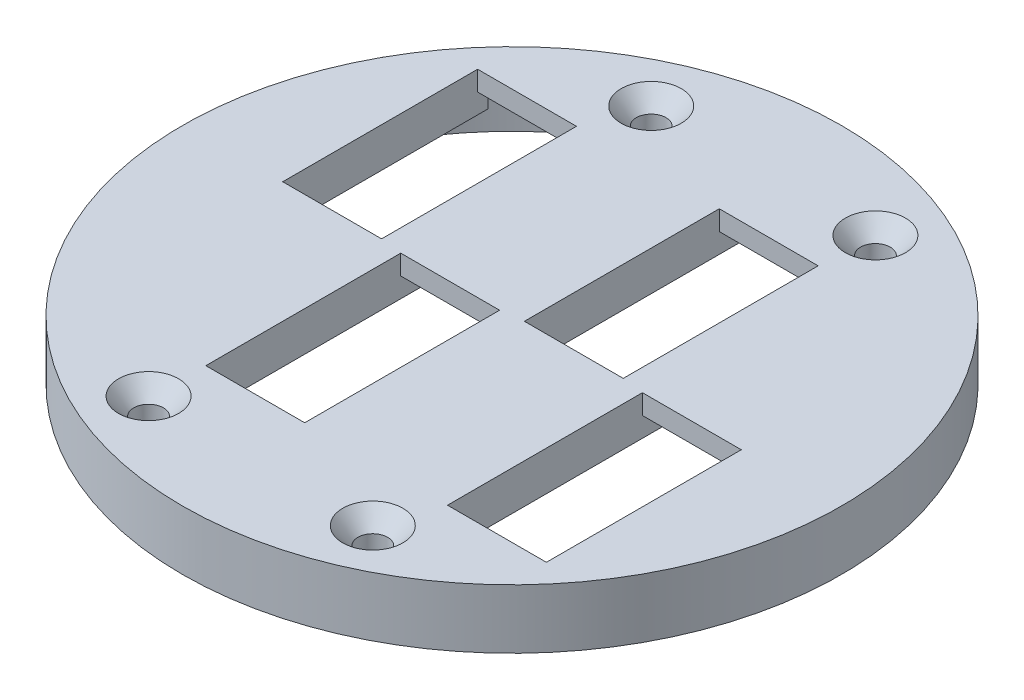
ISO-10303-21;
HEADER;
FILE_DESCRIPTION(('STEP AP214'),'2;1');
FILE_NAME('part.step','',(''),(''),'','','');
FILE_SCHEMA(('AUTOMOTIVE_DESIGN { 1 0 10303 214 1 1 1 1 }'));
ENDSEC;
DATA;
#1=APPLICATION_CONTEXT('core data for automotive mechanical design processes');
#2=APPLICATION_PROTOCOL_DEFINITION('international standard','automotive_design',2000,#1);
#3=PRODUCT_CONTEXT('',#1,'mechanical');
#4=PRODUCT('Part','Part','',(#3));
#5=PRODUCT_RELATED_PRODUCT_CATEGORY('part','',(#4));
#6=PRODUCT_DEFINITION_FORMATION('','',#4);
#7=PRODUCT_DEFINITION_CONTEXT('part definition',#1,'design');
#8=PRODUCT_DEFINITION('design','',#6,#7);
#9=PRODUCT_DEFINITION_SHAPE('','',#8);
#10=(LENGTH_UNIT() NAMED_UNIT(*) SI_UNIT(.MILLI.,.METRE.));
#11=(NAMED_UNIT(*) PLANE_ANGLE_UNIT() SI_UNIT($,.RADIAN.));
#12=(NAMED_UNIT(*) SI_UNIT($,.STERADIAN.) SOLID_ANGLE_UNIT());
#13=UNCERTAINTY_MEASURE_WITH_UNIT(LENGTH_MEASURE(1.E-05),#10,'distance_accuracy_value','');
#14=(GEOMETRIC_REPRESENTATION_CONTEXT(3) GLOBAL_UNCERTAINTY_ASSIGNED_CONTEXT((#13)) GLOBAL_UNIT_ASSIGNED_CONTEXT((#10,
#11,#12)) REPRESENTATION_CONTEXT('',''));
#15=CARTESIAN_POINT('',(0.,0.,0.));
#16=DIRECTION('',(0.,0.,1.));
#17=DIRECTION('',(1.,0.,0.));
#18=AXIS2_PLACEMENT_3D('',#15,#16,#17);
#19=CARTESIAN_POINT('',(0.,-7.5,0.));
#20=DIRECTION('',(0.,1.,0.));
#21=DIRECTION('',(0.,0.,1.));
#22=AXIS2_PLACEMENT_3D('',#19,#20,#21);
#23=CYLINDRICAL_SURFACE('',#22,47.);
#24=CARTESIAN_POINT('',(0.,-7.5,0.));
#25=DIRECTION('',(0.,-1.,0.));
#26=DIRECTION('',(0.,0.,-1.));
#27=AXIS2_PLACEMENT_3D('',#24,#25,#26);
#28=CIRCLE('',#27,47.);
#29=CARTESIAN_POINT('',(0.,-7.5,-47.));
#30=VERTEX_POINT('',#29);
#31=EDGE_CURVE('E545',#30,#30,#28,.T.);
#32=ORIENTED_EDGE('',*,*,#31,.T.);
#33=EDGE_LOOP('',(#32));
#34=FACE_BOUND('',#33,.T.);
#35=CARTESIAN_POINT('',(0.,-4.5,0.));
#36=DIRECTION('',(0.,-1.,0.));
#37=DIRECTION('',(0.,0.,-1.));
#38=AXIS2_PLACEMENT_3D('',#35,#36,#37);
#39=CIRCLE('',#38,47.);
#40=CARTESIAN_POINT('',(32.6745010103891,-4.5,33.7842712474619));
#41=VERTEX_POINT('',#40);
#42=CARTESIAN_POINT('',(16.666666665,-4.50000000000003,43.9456735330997));
#43=VERTEX_POINT('',#42);
#44=EDGE_CURVE('E992',#41,#43,#39,.T.);
#45=ORIENTED_EDGE('',*,*,#44,.F.);
#46=DIRECTION('',(0.,1.,0.));
#47=VECTOR('',#46,1.);
#48=CARTESIAN_POINT('',(32.6745010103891,-19.9003796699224,33.7842712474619));
#49=LINE('',#48,#47);
#50=CARTESIAN_POINT('',(32.6745010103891,-1.5,33.7842712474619));
#51=VERTEX_POINT('',#50);
#52=EDGE_CURVE('E495',#41,#51,#49,.T.);
#53=ORIENTED_EDGE('',*,*,#52,.T.);
#54=CARTESIAN_POINT('',(0.,-1.5,0.));
#55=DIRECTION('',(0.,1.,0.));
#56=DIRECTION('',(0.,0.,1.));
#57=AXIS2_PLACEMENT_3D('',#54,#55,#56);
#58=CIRCLE('',#57,47.);
#59=CARTESIAN_POINT('',(34.9999999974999,-1.5,31.3687742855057));
#60=VERTEX_POINT('',#59);
#61=EDGE_CURVE('E686',#51,#60,#58,.T.);
#62=ORIENTED_EDGE('',*,*,#61,.T.);
#63=DIRECTION('',(0.,1.,0.));
#64=VECTOR('',#63,1.);
#65=CARTESIAN_POINT('',(34.9999999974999,-98.5590830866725,31.3687742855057));
#66=LINE('',#65,#64);
#67=CARTESIAN_POINT('',(34.9999999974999,-4.50000000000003,31.3687742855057));
#68=VERTEX_POINT('',#67);
#69=EDGE_CURVE('E980',#68,#60,#66,.T.);
#70=ORIENTED_EDGE('',*,*,#69,.F.);
#71=CARTESIAN_POINT('',(0.,-4.5,0.));
#72=DIRECTION('',(0.,-1.,0.));
#73=DIRECTION('',(0.,0.,-1.));
#74=AXIS2_PLACEMENT_3D('',#71,#72,#73);
#75=CIRCLE('',#74,47.);
#76=CARTESIAN_POINT('',(37.9999999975,-4.5,27.6586333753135));
#77=VERTEX_POINT('',#76);
#78=EDGE_CURVE('E975',#77,#68,#75,.T.);
#79=ORIENTED_EDGE('',*,*,#78,.F.);
#80=DIRECTION('',(0.,1.,0.));
#81=VECTOR('',#80,1.);
#82=CARTESIAN_POINT('',(37.9999999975,-98.5590830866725,27.6586333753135));
#83=LINE('',#82,#81);
#84=CARTESIAN_POINT('',(37.9999999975,-1.5,27.6586333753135));
#85=VERTEX_POINT('',#84);
#86=EDGE_CURVE('E941',#77,#85,#83,.T.);
#87=ORIENTED_EDGE('',*,*,#86,.T.);
#88=CARTESIAN_POINT('',(37.9999999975,-1.5,-27.6586333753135));
#89=VERTEX_POINT('',#88);
#90=EDGE_CURVE('E1270',#85,#89,#58,.T.);
#91=ORIENTED_EDGE('',*,*,#90,.T.);
#92=DIRECTION('',(0.,1.,0.));
#93=VECTOR('',#92,1.);
#94=CARTESIAN_POINT('',(37.9999999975,-98.5590830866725,-27.6586333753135));
#95=LINE('',#94,#93);
#96=CARTESIAN_POINT('',(37.9999999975,-4.50000000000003,-27.6586333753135));
#97=VERTEX_POINT('',#96);
#98=EDGE_CURVE('E962',#97,#89,#95,.T.);
#99=ORIENTED_EDGE('',*,*,#98,.F.);
#100=CARTESIAN_POINT('',(0.,-4.5,0.));
#101=DIRECTION('',(0.,-1.,0.));
#102=DIRECTION('',(0.,0.,-1.));
#103=AXIS2_PLACEMENT_3D('',#100,#101,#102);
#104=CIRCLE('',#103,47.);
#105=CARTESIAN_POINT('',(34.9999999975,-4.50000000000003,-31.3687742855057));
#106=VERTEX_POINT('',#105);
#107=EDGE_CURVE('E968',#106,#97,#104,.T.);
#108=ORIENTED_EDGE('',*,*,#107,.F.);
#109=DIRECTION('',(0.,1.,0.));
#110=VECTOR('',#109,1.);
#111=CARTESIAN_POINT('',(34.9999999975,-98.5590830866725,-31.3687742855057));
#112=LINE('',#111,#110);
#113=CARTESIAN_POINT('',(34.9999999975,-1.5,-31.3687742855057));
#114=VERTEX_POINT('',#113);
#115=EDGE_CURVE('E965',#106,#114,#112,.T.);
#116=ORIENTED_EDGE('',*,*,#115,.T.);
#117=CARTESIAN_POINT('',(19.9999999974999,-1.5,-42.5323406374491));
#118=VERTEX_POINT('',#117);
#119=EDGE_CURVE('E1266',#114,#118,#58,.T.);
#120=ORIENTED_EDGE('',*,*,#119,.T.);
#121=DIRECTION('',(0.,1.,0.));
#122=VECTOR('',#121,1.);
#123=CARTESIAN_POINT('',(19.9999999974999,-98.5590830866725,-42.5323406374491));
#124=LINE('',#123,#122);
#125=CARTESIAN_POINT('',(19.9999999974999,-4.50000000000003,-42.5323406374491));
#126=VERTEX_POINT('',#125);
#127=EDGE_CURVE('E886',#126,#118,#124,.T.);
#128=ORIENTED_EDGE('',*,*,#127,.F.);
#129=CARTESIAN_POINT('',(0.,-4.5,0.));
#130=DIRECTION('',(0.,-1.,0.));
#131=DIRECTION('',(0.,0.,-1.));
#132=AXIS2_PLACEMENT_3D('',#129,#130,#131);
#133=CIRCLE('',#132,47.);
#134=CARTESIAN_POINT('',(16.666666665,-4.50000000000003,-43.9456735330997));
#135=VERTEX_POINT('',#134);
#136=EDGE_CURVE('E891',#135,#126,#133,.T.);
#137=ORIENTED_EDGE('',*,*,#136,.F.);
#138=DIRECTION('',(0.,1.,0.));
#139=VECTOR('',#138,1.);
#140=CARTESIAN_POINT('',(16.666666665,-98.5590830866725,-43.9456735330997));
#141=LINE('',#140,#139);
#142=CARTESIAN_POINT('',(16.666666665,-1.5,-43.9456735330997));
#143=VERTEX_POINT('',#142);
#144=EDGE_CURVE('E889',#135,#143,#141,.T.);
#145=ORIENTED_EDGE('',*,*,#144,.T.);
#146=CARTESIAN_POINT('',(1.66666666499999,-1.5,-46.9704398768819));
#147=VERTEX_POINT('',#146);
#148=EDGE_CURVE('E1271',#143,#147,#58,.T.);
#149=ORIENTED_EDGE('',*,*,#148,.T.);
#150=DIRECTION('',(0.,1.,0.));
#151=VECTOR('',#150,1.);
#152=CARTESIAN_POINT('',(1.66666666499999,-98.5590830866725,-46.9704398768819));
#153=LINE('',#152,#151);
#154=CARTESIAN_POINT('',(1.66666666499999,-4.50000000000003,-46.9704398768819));
#155=VERTEX_POINT('',#154);
#156=EDGE_CURVE('E1031',#155,#147,#153,.T.);
#157=ORIENTED_EDGE('',*,*,#156,.F.);
#158=CARTESIAN_POINT('',(0.,-4.5,0.));
#159=DIRECTION('',(0.,-1.,0.));
#160=DIRECTION('',(0.,0.,-1.));
#161=AXIS2_PLACEMENT_3D('',#158,#159,#160);
#162=CIRCLE('',#161,47.);
#163=CARTESIAN_POINT('',(-1.66666666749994,-4.5,-46.9704398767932));
#164=VERTEX_POINT('',#163);
#165=EDGE_CURVE('E536',#164,#155,#162,.T.);
#166=ORIENTED_EDGE('',*,*,#165,.F.);
#167=DIRECTION('',(0.,1.,0.));
#168=VECTOR('',#167,1.);
#169=CARTESIAN_POINT('',(-1.66666666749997,-98.5590830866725,-46.9704398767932));
#170=LINE('',#169,#168);
#171=CARTESIAN_POINT('',(-1.66666666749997,-1.5,-46.9704398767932));
#172=VERTEX_POINT('',#171);
#173=EDGE_CURVE('E1009',#164,#172,#170,.T.);
#174=ORIENTED_EDGE('',*,*,#173,.T.);
#175=CARTESIAN_POINT('',(-16.666666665,-1.5,-43.9456735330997));
#176=VERTEX_POINT('',#175);
#177=EDGE_CURVE('E687',#172,#176,#58,.T.);
#178=ORIENTED_EDGE('',*,*,#177,.T.);
#179=DIRECTION('',(0.,1.,0.));
#180=VECTOR('',#179,1.);
#181=CARTESIAN_POINT('',(-16.666666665,-98.5590830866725,-43.9456735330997));
#182=LINE('',#181,#180);
#183=CARTESIAN_POINT('',(-16.666666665,-4.50000000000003,-43.9456735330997));
#184=VERTEX_POINT('',#183);
#185=EDGE_CURVE('E851',#184,#176,#182,.T.);
#186=ORIENTED_EDGE('',*,*,#185,.F.);
#187=CARTESIAN_POINT('',(0.,-4.5,0.));
#188=DIRECTION('',(0.,-1.,0.));
#189=DIRECTION('',(0.,0.,-1.));
#190=AXIS2_PLACEMENT_3D('',#187,#188,#189);
#191=CIRCLE('',#190,47.);
#192=CARTESIAN_POINT('',(-32.6745010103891,-4.5,-33.7842712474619));
#193=VERTEX_POINT('',#192);
#194=EDGE_CURVE('E852',#193,#184,#191,.T.);
#195=ORIENTED_EDGE('',*,*,#194,.F.);
#196=DIRECTION('',(0.,1.,0.));
#197=VECTOR('',#196,1.);
#198=CARTESIAN_POINT('',(-32.6745010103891,-19.9003796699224,-33.7842712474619));
#199=LINE('',#198,#197);
#200=CARTESIAN_POINT('',(-32.6745010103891,-1.5,-33.7842712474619));
#201=VERTEX_POINT('',#200);
#202=EDGE_CURVE('E750',#193,#201,#199,.T.);
#203=ORIENTED_EDGE('',*,*,#202,.T.);
#204=CARTESIAN_POINT('',(-34.9999999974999,-1.5,-31.3687742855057));
#205=VERTEX_POINT('',#204);
#206=EDGE_CURVE('E1276',#201,#205,#58,.T.);
#207=ORIENTED_EDGE('',*,*,#206,.T.);
#208=DIRECTION('',(0.,1.,0.));
#209=VECTOR('',#208,1.);
#210=CARTESIAN_POINT('',(-34.9999999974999,-98.5590830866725,-31.3687742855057));
#211=LINE('',#210,#209);
#212=CARTESIAN_POINT('',(-34.9999999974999,-4.50000000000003,-31.3687742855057));
#213=VERTEX_POINT('',#212);
#214=EDGE_CURVE('E954',#213,#205,#211,.T.);
#215=ORIENTED_EDGE('',*,*,#214,.F.);
#216=CARTESIAN_POINT('',(0.,-4.5,0.));
#217=DIRECTION('',(0.,-1.,0.));
#218=DIRECTION('',(0.,0.,-1.));
#219=AXIS2_PLACEMENT_3D('',#216,#217,#218);
#220=CIRCLE('',#219,47.);
#221=CARTESIAN_POINT('',(-37.9999999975,-4.50000000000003,-27.6586333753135));
#222=VERTEX_POINT('',#221);
#223=EDGE_CURVE('E938',#222,#213,#220,.T.);
#224=ORIENTED_EDGE('',*,*,#223,.F.);
#225=DIRECTION('',(0.,1.,0.));
#226=VECTOR('',#225,1.);
#227=CARTESIAN_POINT('',(-37.9999999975,-98.5590830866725,-27.6586333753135));
#228=LINE('',#227,#226);
#229=CARTESIAN_POINT('',(-37.9999999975,-1.5,-27.6586333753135));
#230=VERTEX_POINT('',#229);
#231=EDGE_CURVE('E936',#222,#230,#228,.T.);
#232=ORIENTED_EDGE('',*,*,#231,.T.);
#233=CARTESIAN_POINT('',(-37.9999999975,-1.5,27.6586333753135));
#234=VERTEX_POINT('',#233);
#235=EDGE_CURVE('E1272',#230,#234,#58,.T.);
#236=ORIENTED_EDGE('',*,*,#235,.T.);
#237=DIRECTION('',(0.,1.,0.));
#238=VECTOR('',#237,1.);
#239=CARTESIAN_POINT('',(-37.9999999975,-98.5590830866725,27.6586333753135));
#240=LINE('',#239,#238);
#241=CARTESIAN_POINT('',(-37.9999999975,-4.50000000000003,27.6586333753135));
#242=VERTEX_POINT('',#241);
#243=EDGE_CURVE('E937',#242,#234,#240,.T.);
#244=ORIENTED_EDGE('',*,*,#243,.F.);
#245=CARTESIAN_POINT('',(0.,-4.5,0.));
#246=DIRECTION('',(0.,-1.,0.));
#247=DIRECTION('',(0.,0.,-1.));
#248=AXIS2_PLACEMENT_3D('',#245,#246,#247);
#249=CIRCLE('',#248,47.);
#250=CARTESIAN_POINT('',(-34.9999999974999,-4.5,31.3687742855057));
#251=VERTEX_POINT('',#250);
#252=EDGE_CURVE('E945',#251,#242,#249,.T.);
#253=ORIENTED_EDGE('',*,*,#252,.F.);
#254=DIRECTION('',(0.,1.,0.));
#255=VECTOR('',#254,1.);
#256=CARTESIAN_POINT('',(-34.9999999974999,-98.5590830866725,31.3687742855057));
#257=LINE('',#256,#255);
#258=CARTESIAN_POINT('',(-34.9999999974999,-1.5,31.3687742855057));
#259=VERTEX_POINT('',#258);
#260=EDGE_CURVE('E921',#251,#259,#257,.T.);
#261=ORIENTED_EDGE('',*,*,#260,.T.);
#262=CARTESIAN_POINT('',(-19.9999999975,-1.5,42.5323406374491));
#263=VERTEX_POINT('',#262);
#264=EDGE_CURVE('E1274',#259,#263,#58,.T.);
#265=ORIENTED_EDGE('',*,*,#264,.T.);
#266=DIRECTION('',(0.,1.,0.));
#267=VECTOR('',#266,1.);
#268=CARTESIAN_POINT('',(-19.9999999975,-98.5590830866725,42.5323406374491));
#269=LINE('',#268,#267);
#270=CARTESIAN_POINT('',(-19.9999999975,-4.50000000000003,42.5323406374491));
#271=VERTEX_POINT('',#270);
#272=EDGE_CURVE('E863',#271,#263,#269,.T.);
#273=ORIENTED_EDGE('',*,*,#272,.F.);
#274=CARTESIAN_POINT('',(0.,-4.5,0.));
#275=DIRECTION('',(0.,-1.,0.));
#276=DIRECTION('',(0.,0.,-1.));
#277=AXIS2_PLACEMENT_3D('',#274,#275,#276);
#278=CIRCLE('',#277,47.);
#279=CARTESIAN_POINT('',(-16.666666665,-4.50000000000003,43.9456735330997));
#280=VERTEX_POINT('',#279);
#281=EDGE_CURVE('E868',#280,#271,#278,.T.);
#282=ORIENTED_EDGE('',*,*,#281,.F.);
#283=DIRECTION('',(0.,1.,0.));
#284=VECTOR('',#283,1.);
#285=CARTESIAN_POINT('',(-16.666666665,-98.5590830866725,43.9456735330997));
#286=LINE('',#285,#284);
#287=CARTESIAN_POINT('',(-16.666666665,-1.5,43.9456735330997));
#288=VERTEX_POINT('',#287);
#289=EDGE_CURVE('E866',#280,#288,#286,.T.);
#290=ORIENTED_EDGE('',*,*,#289,.T.);
#291=CARTESIAN_POINT('',(-1.66666666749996,-1.5,46.9704398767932));
#292=VERTEX_POINT('',#291);
#293=EDGE_CURVE('E674',#288,#292,#58,.T.);
#294=ORIENTED_EDGE('',*,*,#293,.T.);
#295=DIRECTION('',(0.,1.,0.));
#296=VECTOR('',#295,1.);
#297=CARTESIAN_POINT('',(-1.66666666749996,-98.5590830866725,46.9704398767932));
#298=LINE('',#297,#296);
#299=CARTESIAN_POINT('',(-1.66666666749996,-4.5,46.9704398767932));
#300=VERTEX_POINT('',#299);
#301=EDGE_CURVE('E1025',#300,#292,#298,.T.);
#302=ORIENTED_EDGE('',*,*,#301,.F.);
#303=CARTESIAN_POINT('',(0.,-4.5,0.));
#304=DIRECTION('',(0.,-1.,0.));
#305=DIRECTION('',(0.,0.,-1.));
#306=AXIS2_PLACEMENT_3D('',#303,#304,#305);
#307=CIRCLE('',#306,47.);
#308=CARTESIAN_POINT('',(1.66666666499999,-4.5,46.9704398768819));
#309=VERTEX_POINT('',#308);
#310=EDGE_CURVE('E1019',#309,#300,#307,.T.);
#311=ORIENTED_EDGE('',*,*,#310,.F.);
#312=DIRECTION('',(0.,1.,0.));
#313=VECTOR('',#312,1.);
#314=CARTESIAN_POINT('',(1.66666666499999,-98.5590830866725,46.9704398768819));
#315=LINE('',#314,#313);
#316=CARTESIAN_POINT('',(1.66666666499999,-1.5,46.9704398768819));
#317=VERTEX_POINT('',#316);
#318=EDGE_CURVE('E995',#309,#317,#315,.T.);
#319=ORIENTED_EDGE('',*,*,#318,.T.);
#320=CARTESIAN_POINT('',(16.666666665,-1.5,43.9456735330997));
#321=VERTEX_POINT('',#320);
#322=EDGE_CURVE('E682',#317,#321,#58,.T.);
#323=ORIENTED_EDGE('',*,*,#322,.T.);
#324=DIRECTION('',(0.,1.,0.));
#325=VECTOR('',#324,1.);
#326=CARTESIAN_POINT('',(16.666666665,-98.5590830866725,43.9456735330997));
#327=LINE('',#326,#325);
#328=EDGE_CURVE('E991',#43,#321,#327,.T.);
#329=ORIENTED_EDGE('',*,*,#328,.F.);
#330=EDGE_LOOP('',(#45,#53,#62,#70,#79,#87,#91,#99,#108,#116,#120,#128,#137,#145,#149,#157,#166,
#174,#178,#186,#195,#203,#207,#215,#224,#232,#236,#244,#253,#261,#265,#273,#282,#290,#294,#302,
#311,#319,#323,#329));
#331=FACE_BOUND('',#330,.T.);
#332=ADVANCED_FACE('F39',(#34,#331),#23,.F.);
#333=CARTESIAN_POINT('',(19.9999999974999,1.5,29.7842712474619));
#334=DIRECTION('',(-1.,0.,0.));
#335=DIRECTION('',(0.,0.,1.));
#336=AXIS2_PLACEMENT_3D('',#333,#334,#335);
#337=PLANE('',#336);
#338=DIRECTION('',(0.,1.,0.));
#339=VECTOR('',#338,1.);
#340=CARTESIAN_POINT('',(19.9999999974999,-19.9003796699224,33.7842712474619));
#341=LINE('',#340,#339);
#342=CARTESIAN_POINT('',(19.9999999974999,-4.5,33.7842712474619));
#343=VERTEX_POINT('',#342);
#344=CARTESIAN_POINT('',(19.9999999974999,-1.5,33.7842712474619));
#345=VERTEX_POINT('',#344);
#346=EDGE_CURVE('E492',#343,#345,#341,.T.);
#347=ORIENTED_EDGE('',*,*,#346,.F.);
#348=DIRECTION('',(0.,0.,1.));
#349=VECTOR('',#348,1.);
#350=CARTESIAN_POINT('',(19.9999999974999,-4.5,-35.4718287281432));
#351=LINE('',#350,#349);
#352=CARTESIAN_POINT('',(19.9999999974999,-4.5,-3.78722875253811));
#353=VERTEX_POINT('',#352);
#354=EDGE_CURVE('E506',#353,#343,#351,.T.);
#355=ORIENTED_EDGE('',*,*,#354,.F.);
#356=DIRECTION('',(0.,1.,0.));
#357=VECTOR('',#356,1.);
#358=CARTESIAN_POINT('',(19.9999999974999,-19.9003796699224,-3.78722875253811));
#359=LINE('',#358,#357);
#360=CARTESIAN_POINT('',(19.9999999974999,-1.5,-3.78722875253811));
#361=VERTEX_POINT('',#360);
#362=EDGE_CURVE('E838',#353,#361,#359,.T.);
#363=ORIENTED_EDGE('',*,*,#362,.T.);
#364=DIRECTION('',(0.,0.,1.));
#365=VECTOR('',#364,1.);
#366=CARTESIAN_POINT('',(19.9999999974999,-1.5,-35.4718287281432));
#367=LINE('',#366,#365);
#368=CARTESIAN_POINT('',(19.9999999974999,-1.5,0.212771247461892));
#369=VERTEX_POINT('',#368);
#370=EDGE_CURVE('E526',#361,#369,#367,.T.);
#371=ORIENTED_EDGE('',*,*,#370,.T.);
#372=DIRECTION('',(0.,-1.,0.));
#373=VECTOR('',#372,1.);
#374=CARTESIAN_POINT('',(19.9999999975,1.5,0.212771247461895));
#375=LINE('',#374,#373);
#376=CARTESIAN_POINT('',(19.9999999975,1.5,0.212771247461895));
#377=VERTEX_POINT('',#376);
#378=EDGE_CURVE('E675',#377,#369,#375,.T.);
#379=ORIENTED_EDGE('',*,*,#378,.F.);
#380=DIRECTION('',(0.,0.,-1.));
#381=VECTOR('',#380,1.);
#382=CARTESIAN_POINT('',(19.9999999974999,1.5,29.7842712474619));
#383=LINE('',#382,#381);
#384=CARTESIAN_POINT('',(19.9999999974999,1.5,29.7842712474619));
#385=VERTEX_POINT('',#384);
#386=EDGE_CURVE('E659',#385,#377,#383,.T.);
#387=ORIENTED_EDGE('',*,*,#386,.F.);
#388=DIRECTION('',(0.,-1.,0.));
#389=VECTOR('',#388,1.);
#390=CARTESIAN_POINT('',(19.9999999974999,1.5,29.7842712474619));
#391=LINE('',#390,#389);
#392=CARTESIAN_POINT('',(19.9999999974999,-1.5,29.7842712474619));
#393=VERTEX_POINT('',#392);
#394=EDGE_CURVE('E678',#385,#393,#391,.T.);
#395=ORIENTED_EDGE('',*,*,#394,.T.);
#396=EDGE_CURVE('E508',#393,#345,#367,.T.);
#397=ORIENTED_EDGE('',*,*,#396,.T.);
#398=EDGE_LOOP('',(#347,#355,#363,#371,#379,#387,#395,#397));
#399=FACE_BOUND('',#398,.T.);
#400=ADVANCED_FACE('F504',(#399),#337,.F.);
#401=CARTESIAN_POINT('',(0.,-1.5,0.));
#402=DIRECTION('',(0.,1.,0.));
#403=DIRECTION('',(0.,0.,1.));
#404=AXIS2_PLACEMENT_3D('',#401,#402,#403);
#405=PLANE('',#404);
#406=DIRECTION('',(1.,0.,0.));
#407=VECTOR('',#406,1.);
#408=CARTESIAN_POINT('',(32.6745010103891,-1.5,33.7842712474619));
#409=LINE('',#408,#407);
#410=EDGE_CURVE('E509',#345,#51,#409,.T.);
#411=ORIENTED_EDGE('',*,*,#410,.F.);
#412=ORIENTED_EDGE('',*,*,#396,.F.);
#413=DIRECTION('',(-1.,0.,0.));
#414=VECTOR('',#413,1.);
#415=CARTESIAN_POINT('',(34.9999999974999,-1.5,29.7842712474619));
#416=LINE('',#415,#414);
#417=CARTESIAN_POINT('',(34.9999999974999,-1.5,29.7842712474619));
#418=VERTEX_POINT('',#417);
#419=EDGE_CURVE('E643',#418,#393,#416,.T.);
#420=ORIENTED_EDGE('',*,*,#419,.F.);
#421=DIRECTION('',(0.,0.,-1.));
#422=VECTOR('',#421,1.);
#423=CARTESIAN_POINT('',(34.9999999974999,-1.5,31.3687742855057));
#424=LINE('',#423,#422);
#425=EDGE_CURVE('E963',#60,#418,#424,.T.);
#426=ORIENTED_EDGE('',*,*,#425,.F.);
#427=ORIENTED_EDGE('',*,*,#61,.F.);
#428=EDGE_LOOP('',(#411,#412,#420,#426,#427));
#429=FACE_BOUND('',#428,.T.);
#430=ADVANCED_FACE('F1116',(#429),#405,.F.);
#431=CARTESIAN_POINT('',(-1.66666666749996,1.5,29.7842712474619));
#432=DIRECTION('',(1.,0.,0.));
#433=DIRECTION('',(0.,0.,-1.));
#434=AXIS2_PLACEMENT_3D('',#431,#432,#433);
#435=PLANE('',#434);
#436=DIRECTION('',(0.,1.,0.));
#437=VECTOR('',#436,1.);
#438=CARTESIAN_POINT('',(-1.66666666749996,-19.9003796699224,36.7842712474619));
#439=LINE('',#438,#437);
#440=CARTESIAN_POINT('',(-1.66666666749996,-4.5,36.7842712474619));
#441=VERTEX_POINT('',#440);
#442=CARTESIAN_POINT('',(-1.66666666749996,-1.5,36.7842712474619));
#443=VERTEX_POINT('',#442);
#444=EDGE_CURVE('E735',#441,#443,#439,.T.);
#445=ORIENTED_EDGE('',*,*,#444,.F.);
#446=DIRECTION('',(0.,0.,-1.));
#447=VECTOR('',#446,1.);
#448=CARTESIAN_POINT('',(-1.66666666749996,-4.5,46.9704398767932));
#449=LINE('',#448,#447);
#450=EDGE_CURVE('E1014',#300,#441,#449,.T.);
#451=ORIENTED_EDGE('',*,*,#450,.F.);
#452=ORIENTED_EDGE('',*,*,#301,.T.);
#453=DIRECTION('',(0.,0.,-1.));
#454=VECTOR('',#453,1.);
#455=CARTESIAN_POINT('',(-1.66666666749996,-1.5,46.9704398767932));
#456=LINE('',#455,#454);
#457=EDGE_CURVE('E1006',#292,#443,#456,.T.);
#458=ORIENTED_EDGE('',*,*,#457,.T.);
#459=EDGE_LOOP('',(#445,#451,#452,#458));
#460=FACE_BOUND('',#459,.T.);
#461=ADVANCED_FACE('F1190',(#460),#435,.F.);
#462=DIRECTION('',(0.,1.,0.));
#463=VECTOR('',#462,1.);
#464=CARTESIAN_POINT('',(-1.66666666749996,-19.9003796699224,33.7842712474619));
#465=LINE('',#464,#463);
#466=CARTESIAN_POINT('',(-1.66666666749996,-4.5,33.7842712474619));
#467=VERTEX_POINT('',#466);
#468=CARTESIAN_POINT('',(-1.66666666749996,-1.5,33.7842712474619));
#469=VERTEX_POINT('',#468);
#470=EDGE_CURVE('E499',#467,#469,#465,.T.);
#471=ORIENTED_EDGE('',*,*,#470,.T.);
#472=CARTESIAN_POINT('',(-1.66666666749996,-1.5,29.7842712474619));
#473=VERTEX_POINT('',#472);
#474=EDGE_CURVE('E1010',#469,#473,#456,.T.);
#475=ORIENTED_EDGE('',*,*,#474,.T.);
#476=DIRECTION('',(0.,-1.,0.));
#477=VECTOR('',#476,1.);
#478=CARTESIAN_POINT('',(-1.66666666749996,1.5,29.7842712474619));
#479=LINE('',#478,#477);
#480=CARTESIAN_POINT('',(-1.66666666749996,1.5,29.7842712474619));
#481=VERTEX_POINT('',#480);
#482=EDGE_CURVE('E605',#481,#473,#479,.T.);
#483=ORIENTED_EDGE('',*,*,#482,.F.);
#484=DIRECTION('',(0.,0.,1.));
#485=VECTOR('',#484,1.);
#486=CARTESIAN_POINT('',(-1.66666666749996,1.5,29.7842712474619));
#487=LINE('',#486,#485);
#488=CARTESIAN_POINT('',(-1.66666666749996,1.5,0.212771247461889));
#489=VERTEX_POINT('',#488);
#490=EDGE_CURVE('E592',#489,#481,#487,.T.);
#491=ORIENTED_EDGE('',*,*,#490,.F.);
#492=DIRECTION('',(0.,-1.,0.));
#493=VECTOR('',#492,1.);
#494=CARTESIAN_POINT('',(-1.66666666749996,1.5,0.212771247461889));
#495=LINE('',#494,#493);
#496=CARTESIAN_POINT('',(-1.66666666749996,-1.5,0.212771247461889));
#497=VERTEX_POINT('',#496);
#498=EDGE_CURVE('E610',#489,#497,#495,.T.);
#499=ORIENTED_EDGE('',*,*,#498,.T.);
#500=CARTESIAN_POINT('',(-1.66666666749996,-1.5,-3.78722875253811));
#501=VERTEX_POINT('',#500);
#502=EDGE_CURVE('E1011',#497,#501,#456,.T.);
#503=ORIENTED_EDGE('',*,*,#502,.T.);
#504=DIRECTION('',(0.,1.,0.));
#505=VECTOR('',#504,1.);
#506=CARTESIAN_POINT('',(-1.66666666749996,-19.9003796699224,-3.78722875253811));
#507=LINE('',#506,#505);
#508=CARTESIAN_POINT('',(-1.66666666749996,-4.5,-3.78722875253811));
#509=VERTEX_POINT('',#508);
#510=EDGE_CURVE('E801',#509,#501,#507,.T.);
#511=ORIENTED_EDGE('',*,*,#510,.F.);
#512=EDGE_CURVE('E1017',#467,#509,#449,.T.);
#513=ORIENTED_EDGE('',*,*,#512,.F.);
#514=EDGE_LOOP('',(#471,#475,#483,#491,#499,#503,#511,#513));
#515=FACE_BOUND('',#514,.T.);
#516=ADVANCED_FACE('F1184',(#515),#435,.F.);
#517=CARTESIAN_POINT('',(-16.6666666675,1.5,29.7842712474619));
#518=DIRECTION('',(-1.,0.,0.));
#519=DIRECTION('',(0.,0.,1.));
#520=AXIS2_PLACEMENT_3D('',#517,#518,#519);
#521=PLANE('',#520);
#522=DIRECTION('',(0.,1.,0.));
#523=VECTOR('',#522,1.);
#524=CARTESIAN_POINT('',(-16.666666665,-19.9003796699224,33.7842712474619));
#525=LINE('',#524,#523);
#526=CARTESIAN_POINT('',(-16.666666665,-4.5,33.7842712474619));
#527=VERTEX_POINT('',#526);
#528=CARTESIAN_POINT('',(-16.666666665,-1.5,33.7842712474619));
#529=VERTEX_POINT('',#528);
#530=EDGE_CURVE('E731',#527,#529,#525,.T.);
#531=ORIENTED_EDGE('',*,*,#530,.F.);
#532=DIRECTION('',(0.,0.,1.));
#533=VECTOR('',#532,1.);
#534=CARTESIAN_POINT('',(-16.666666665,-4.5,34.1427403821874));
#535=LINE('',#534,#533);
#536=CARTESIAN_POINT('',(-16.666666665,-4.5,-3.78722875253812));
#537=VERTEX_POINT('',#536);
#538=EDGE_CURVE('E922',#537,#527,#535,.T.);
#539=ORIENTED_EDGE('',*,*,#538,.F.);
#540=DIRECTION('',(0.,1.,0.));
#541=VECTOR('',#540,1.);
#542=CARTESIAN_POINT('',(-16.666666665,-19.9003796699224,-3.78722875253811));
#543=LINE('',#542,#541);
#544=CARTESIAN_POINT('',(-16.666666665,-1.5,-3.78722875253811));
#545=VERTEX_POINT('',#544);
#546=EDGE_CURVE('E800',#537,#545,#543,.T.);
#547=ORIENTED_EDGE('',*,*,#546,.T.);
#548=DIRECTION('',(0.,0.,1.));
#549=VECTOR('',#548,1.);
#550=CARTESIAN_POINT('',(-16.666666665,-1.5,34.1427403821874));
#551=LINE('',#550,#549);
#552=CARTESIAN_POINT('',(-16.666666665,-1.5,0.212771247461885));
#553=VERTEX_POINT('',#552);
#554=EDGE_CURVE('E916',#545,#553,#551,.T.);
#555=ORIENTED_EDGE('',*,*,#554,.T.);
#556=DIRECTION('',(0.,-1.,0.));
#557=VECTOR('',#556,1.);
#558=CARTESIAN_POINT('',(-16.6666666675,1.5,0.212771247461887));
#559=LINE('',#558,#557);
#560=CARTESIAN_POINT('',(-16.6666666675,1.5,0.212771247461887));
#561=VERTEX_POINT('',#560);
#562=EDGE_CURVE('E614',#561,#553,#559,.T.);
#563=ORIENTED_EDGE('',*,*,#562,.F.);
#564=DIRECTION('',(0.,0.,-1.));
#565=VECTOR('',#564,1.);
#566=CARTESIAN_POINT('',(-16.6666666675,1.5,29.7842712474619));
#567=LINE('',#566,#565);
#568=CARTESIAN_POINT('',(-16.6666666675,1.5,29.7842712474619));
#569=VERTEX_POINT('',#568);
#570=EDGE_CURVE('E599',#569,#561,#567,.T.);
#571=ORIENTED_EDGE('',*,*,#570,.F.);
#572=DIRECTION('',(0.,-1.,0.));
#573=VECTOR('',#572,1.);
#574=CARTESIAN_POINT('',(-16.6666666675,1.5,29.7842712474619));
#575=LINE('',#574,#573);
#576=CARTESIAN_POINT('',(-16.666666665,-1.5,29.7842712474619));
#577=VERTEX_POINT('',#576);
#578=EDGE_CURVE('E617',#569,#577,#575,.T.);
#579=ORIENTED_EDGE('',*,*,#578,.T.);
#580=EDGE_CURVE('E917',#577,#529,#551,.T.);
#581=ORIENTED_EDGE('',*,*,#580,.T.);
#582=EDGE_LOOP('',(#531,#539,#547,#555,#563,#571,#579,#581));
#583=FACE_BOUND('',#582,.T.);
#584=ADVANCED_FACE('F1180',(#583),#521,.F.);
#585=DIRECTION('',(-1.,0.,0.));
#586=VECTOR('',#585,1.);
#587=CARTESIAN_POINT('',(-1.66666666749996,-1.5,36.7842712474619));
#588=LINE('',#587,#586);
#589=CARTESIAN_POINT('',(-13.2417296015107,-1.5,36.7842712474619));
#590=VERTEX_POINT('',#589);
#591=EDGE_CURVE('E732',#443,#590,#588,.T.);
#592=ORIENTED_EDGE('',*,*,#591,.F.);
#593=ORIENTED_EDGE('',*,*,#457,.F.);
#594=ORIENTED_EDGE('',*,*,#293,.F.);
#595=DIRECTION('',(0.,0.,1.));
#596=VECTOR('',#595,1.);
#597=CARTESIAN_POINT('',(-16.666666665,-1.5,42.1133439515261));
#598=LINE('',#597,#596);
#599=CARTESIAN_POINT('',(-16.666666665,-1.5,42.1133439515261));
#600=VERTEX_POINT('',#599);
#601=EDGE_CURVE('E864',#600,#288,#598,.T.);
#602=ORIENTED_EDGE('',*,*,#601,.F.);
#603=CARTESIAN_POINT('',(-17.0092592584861,-1.5,38.1280421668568));
#604=DIRECTION('',(0.,1.,0.));
#605=DIRECTION('',(0.,0.,1.));
#606=AXIS2_PLACEMENT_3D('',#603,#604,#605);
#607=CIRCLE('',#606,4.);
#608=EDGE_CURVE('E11',#590,#600,#607,.F.);
#609=ORIENTED_EDGE('',*,*,#608,.F.);
#610=EDGE_LOOP('',(#592,#593,#594,#602,#609));
#611=FACE_BOUND('',#610,.T.);
#612=ADVANCED_FACE('F1183',(#611),#405,.F.);
#613=DIRECTION('',(1.,0.,0.));
#614=VECTOR('',#613,1.);
#615=CARTESIAN_POINT('',(-1.66666666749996,-1.5,33.7842712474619));
#616=LINE('',#615,#614);
#617=EDGE_CURVE('E728',#529,#469,#616,.T.);
#618=ORIENTED_EDGE('',*,*,#617,.F.);
#619=ORIENTED_EDGE('',*,*,#580,.F.);
#620=DIRECTION('',(-1.,0.,0.));
#621=VECTOR('',#620,1.);
#622=CARTESIAN_POINT('',(-1.66666666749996,-1.5,29.7842712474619));
#623=LINE('',#622,#621);
#624=EDGE_CURVE('E583',#473,#577,#623,.T.);
#625=ORIENTED_EDGE('',*,*,#624,.F.);
#626=ORIENTED_EDGE('',*,*,#474,.F.);
#627=EDGE_LOOP('',(#618,#619,#625,#626));
#628=FACE_BOUND('',#627,.T.);
#629=ADVANCED_FACE('F1135',(#628),#405,.F.);
#630=CARTESIAN_POINT('',(-17.0092592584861,-4.5,38.1280421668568));
#631=DIRECTION('',(0.,1.,0.));
#632=DIRECTION('',(0.,0.,1.));
#633=AXIS2_PLACEMENT_3D('',#630,#631,#632);
#634=CYLINDRICAL_SURFACE('',#633,4.);
#635=DIRECTION('',(0.,1.,0.));
#636=VECTOR('',#635,1.);
#637=CARTESIAN_POINT('',(-13.2417296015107,-19.9003796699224,36.7842712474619));
#638=LINE('',#637,#636);
#639=CARTESIAN_POINT('',(-13.2417296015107,-4.5,36.7842712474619));
#640=VERTEX_POINT('',#639);
#641=EDGE_CURVE('E734',#640,#590,#638,.T.);
#642=ORIENTED_EDGE('',*,*,#641,.T.);
#643=ORIENTED_EDGE('',*,*,#608,.T.);
#644=DIRECTION('',(0.,1.,0.));
#645=VECTOR('',#644,1.);
#646=CARTESIAN_POINT('',(-16.666666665,-98.5590830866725,42.1133439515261));
#647=LINE('',#646,#645);
#648=CARTESIAN_POINT('',(-16.666666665,-4.50000000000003,42.1133439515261));
#649=VERTEX_POINT('',#648);
#650=EDGE_CURVE('E867',#649,#600,#647,.T.);
#651=ORIENTED_EDGE('',*,*,#650,.F.);
#652=CARTESIAN_POINT('',(-17.0092592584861,-4.5,38.1280421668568));
#653=DIRECTION('',(0.,-1.,0.));
#654=DIRECTION('',(0.,0.,-1.));
#655=AXIS2_PLACEMENT_3D('',#652,#653,#654);
#656=CIRCLE('',#655,4.);
#657=EDGE_CURVE('E552',#640,#649,#656,.T.);
#658=ORIENTED_EDGE('',*,*,#657,.F.);
#659=EDGE_LOOP('',(#642,#643,#651,#658));
#660=FACE_BOUND('',#659,.T.);
#661=ADVANCED_FACE('F1131',(#660),#634,.T.);
#662=CARTESIAN_POINT('',(-19.9999999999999,1.5,-0.2127712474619));
#663=DIRECTION('',(1.,0.,0.));
#664=DIRECTION('',(0.,0.,-1.));
#665=AXIS2_PLACEMENT_3D('',#662,#663,#664);
#666=PLANE('',#665);
#667=DIRECTION('',(0.,1.,0.));
#668=VECTOR('',#667,1.);
#669=CARTESIAN_POINT('',(-19.9999999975,-19.9003796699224,-33.7842712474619));
#670=LINE('',#669,#668);
#671=CARTESIAN_POINT('',(-19.9999999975,-4.5,-33.7842712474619));
#672=VERTEX_POINT('',#671);
#673=CARTESIAN_POINT('',(-19.9999999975,-1.5,-33.7842712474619));
#674=VERTEX_POINT('',#673);
#675=EDGE_CURVE('E739',#672,#674,#670,.T.);
#676=ORIENTED_EDGE('',*,*,#675,.F.);
#677=DIRECTION('',(0.,0.,-1.));
#678=VECTOR('',#677,1.);
#679=CARTESIAN_POINT('',(-19.9999999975,-4.5,-35.4718287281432));
#680=LINE('',#679,#678);
#681=CARTESIAN_POINT('',(-19.9999999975,-4.5,3.7872287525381));
#682=VERTEX_POINT('',#681);
#683=EDGE_CURVE('E909',#682,#672,#680,.T.);
#684=ORIENTED_EDGE('',*,*,#683,.F.);
#685=DIRECTION('',(0.,1.,0.));
#686=VECTOR('',#685,1.);
#687=CARTESIAN_POINT('',(-19.9999999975,-19.9003796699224,3.7872287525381));
#688=LINE('',#687,#686);
#689=CARTESIAN_POINT('',(-19.9999999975,-1.5,3.7872287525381));
#690=VERTEX_POINT('',#689);
#691=EDGE_CURVE('E766',#682,#690,#688,.T.);
#692=ORIENTED_EDGE('',*,*,#691,.T.);
#693=DIRECTION('',(0.,0.,-1.));
#694=VECTOR('',#693,1.);
#695=CARTESIAN_POINT('',(-19.9999999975,-1.5,-35.4718287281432));
#696=LINE('',#695,#694);
#697=CARTESIAN_POINT('',(-19.9999999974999,-1.5,-0.212771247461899));
#698=VERTEX_POINT('',#697);
#699=EDGE_CURVE('E910',#690,#698,#696,.T.);
#700=ORIENTED_EDGE('',*,*,#699,.T.);
#701=DIRECTION('',(0.,-1.,0.));
#702=VECTOR('',#701,1.);
#703=CARTESIAN_POINT('',(-19.9999999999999,1.5,-0.2127712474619));
#704=LINE('',#703,#702);
#705=CARTESIAN_POINT('',(-19.9999999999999,1.5,-0.2127712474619));
#706=VERTEX_POINT('',#705);
#707=EDGE_CURVE('E575',#706,#698,#704,.T.);
#708=ORIENTED_EDGE('',*,*,#707,.F.);
#709=DIRECTION('',(0.,0.,1.));
#710=VECTOR('',#709,1.);
#711=CARTESIAN_POINT('',(-19.9999999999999,1.5,-0.2127712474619));
#712=LINE('',#711,#710);
#713=CARTESIAN_POINT('',(-19.9999999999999,1.5,-29.7842712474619));
#714=VERTEX_POINT('',#713);
#715=EDGE_CURVE('E562',#714,#706,#712,.T.);
#716=ORIENTED_EDGE('',*,*,#715,.F.);
#717=DIRECTION('',(0.,-1.,0.));
#718=VECTOR('',#717,1.);
#719=CARTESIAN_POINT('',(-19.9999999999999,1.5,-29.7842712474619));
#720=LINE('',#719,#718);
#721=CARTESIAN_POINT('',(-19.9999999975,-1.5,-29.7842712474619));
#722=VERTEX_POINT('',#721);
#723=EDGE_CURVE('E580',#714,#722,#720,.T.);
#724=ORIENTED_EDGE('',*,*,#723,.T.);
#725=EDGE_CURVE('E911',#722,#674,#696,.T.);
#726=ORIENTED_EDGE('',*,*,#725,.T.);
#727=EDGE_LOOP('',(#676,#684,#692,#700,#708,#716,#724,#726));
#728=FACE_BOUND('',#727,.T.);
#729=ADVANCED_FACE('F1134',(#728),#666,.F.);
#730=DIRECTION('',(-1.,0.,0.));
#731=VECTOR('',#730,1.);
#732=CARTESIAN_POINT('',(-19.9999999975,-1.5,-33.7842712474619));
#733=LINE('',#732,#731);
#734=EDGE_CURVE('E748',#674,#201,#733,.T.);
#735=ORIENTED_EDGE('',*,*,#734,.F.);
#736=ORIENTED_EDGE('',*,*,#725,.F.);
#737=DIRECTION('',(1.,0.,0.));
#738=VECTOR('',#737,1.);
#739=CARTESIAN_POINT('',(-19.9999999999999,-1.5,-29.7842712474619));
#740=LINE('',#739,#738);
#741=CARTESIAN_POINT('',(-34.9999999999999,-1.5,-29.7842712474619));
#742=VERTEX_POINT('',#741);
#743=EDGE_CURVE('E566',#742,#722,#740,.T.);
#744=ORIENTED_EDGE('',*,*,#743,.F.);
#745=DIRECTION('',(0.,0.,1.));
#746=VECTOR('',#745,1.);
#747=CARTESIAN_POINT('',(-34.9999999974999,-1.5,31.3687742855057));
#748=LINE('',#747,#746);
#749=EDGE_CURVE('E929',#205,#742,#748,.T.);
#750=ORIENTED_EDGE('',*,*,#749,.F.);
#751=ORIENTED_EDGE('',*,*,#206,.F.);
#752=EDGE_LOOP('',(#735,#736,#744,#750,#751));
#753=FACE_BOUND('',#752,.T.);
#754=ADVANCED_FACE('F1335',(#753),#405,.F.);
#755=CARTESIAN_POINT('',(16.666666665,1.5,-0.212771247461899));
#756=DIRECTION('',(1.,0.,0.));
#757=DIRECTION('',(0.,0.,-1.));
#758=AXIS2_PLACEMENT_3D('',#755,#756,#757);
#759=PLANE('',#758);
#760=DIRECTION('',(0.,1.,0.));
#761=VECTOR('',#760,1.);
#762=CARTESIAN_POINT('',(16.666666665,-19.9003796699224,-33.7842712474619));
#763=LINE('',#762,#761);
#764=CARTESIAN_POINT('',(16.666666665,-4.5,-33.7842712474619));
#765=VERTEX_POINT('',#764);
#766=CARTESIAN_POINT('',(16.666666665,-1.5,-33.7842712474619));
#767=VERTEX_POINT('',#766);
#768=EDGE_CURVE('E754',#765,#767,#763,.T.);
#769=ORIENTED_EDGE('',*,*,#768,.F.);
#770=DIRECTION('',(0.,0.,-1.));
#771=VECTOR('',#770,1.);
#772=CARTESIAN_POINT('',(16.666666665,-4.5,34.1427403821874));
#773=LINE('',#772,#771);
#774=CARTESIAN_POINT('',(16.666666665,-4.5,3.7872287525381));
#775=VERTEX_POINT('',#774);
#776=EDGE_CURVE('E524',#775,#765,#773,.T.);
#777=ORIENTED_EDGE('',*,*,#776,.F.);
#778=DIRECTION('',(0.,1.,0.));
#779=VECTOR('',#778,1.);
#780=CARTESIAN_POINT('',(16.666666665,-19.9003796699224,3.7872287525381));
#781=LINE('',#780,#779);
#782=CARTESIAN_POINT('',(16.666666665,-1.5,3.7872287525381));
#783=VERTEX_POINT('',#782);
#784=EDGE_CURVE('E804',#775,#783,#781,.T.);
#785=ORIENTED_EDGE('',*,*,#784,.T.);
#786=DIRECTION('',(0.,0.,-1.));
#787=VECTOR('',#786,1.);
#788=CARTESIAN_POINT('',(16.666666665,-1.5,34.1427403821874));
#789=LINE('',#788,#787);
#790=CARTESIAN_POINT('',(16.666666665,-1.5,-0.212771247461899));
#791=VERTEX_POINT('',#790);
#792=EDGE_CURVE('E1038',#783,#791,#789,.T.);
#793=ORIENTED_EDGE('',*,*,#792,.T.);
#794=DIRECTION('',(0.,-1.,0.));
#795=VECTOR('',#794,1.);
#796=CARTESIAN_POINT('',(16.666666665,1.5,-0.212771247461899));
#797=LINE('',#796,#795);
#798=CARTESIAN_POINT('',(16.666666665,1.5,-0.212771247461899));
#799=VERTEX_POINT('',#798);
#800=EDGE_CURVE('E635',#799,#791,#797,.T.);
#801=ORIENTED_EDGE('',*,*,#800,.F.);
#802=DIRECTION('',(0.,0.,1.));
#803=VECTOR('',#802,1.);
#804=CARTESIAN_POINT('',(16.666666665,1.5,-0.212771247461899));
#805=LINE('',#804,#803);
#806=CARTESIAN_POINT('',(16.666666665,1.5,-29.7842712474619));
#807=VERTEX_POINT('',#806);
#808=EDGE_CURVE('E622',#807,#799,#805,.T.);
#809=ORIENTED_EDGE('',*,*,#808,.F.);
#810=DIRECTION('',(0.,-1.,0.));
#811=VECTOR('',#810,1.);
#812=CARTESIAN_POINT('',(16.666666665,1.5,-29.7842712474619));
#813=LINE('',#812,#811);
#814=CARTESIAN_POINT('',(16.666666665,-1.5,-29.7842712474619));
#815=VERTEX_POINT('',#814);
#816=EDGE_CURVE('E640',#807,#815,#813,.T.);
#817=ORIENTED_EDGE('',*,*,#816,.T.);
#818=EDGE_CURVE('E535',#815,#767,#789,.T.);
#819=ORIENTED_EDGE('',*,*,#818,.T.);
#820=EDGE_LOOP('',(#769,#777,#785,#793,#801,#809,#817,#819));
#821=FACE_BOUND('',#820,.T.);
#822=ADVANCED_FACE('F1046',(#821),#759,.F.);
#823=CARTESIAN_POINT('',(1.66666666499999,1.5,-0.212771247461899));
#824=DIRECTION('',(-1.,0.,0.));
#825=DIRECTION('',(0.,0.,1.));
#826=AXIS2_PLACEMENT_3D('',#823,#824,#825);
#827=PLANE('',#826);
#828=DIRECTION('',(0.,1.,0.));
#829=VECTOR('',#828,1.);
#830=CARTESIAN_POINT('',(1.66666666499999,-19.9003796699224,-33.7842712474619));
#831=LINE('',#830,#829);
#832=CARTESIAN_POINT('',(1.66666666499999,-4.5,-33.7842712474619));
#833=VERTEX_POINT('',#832);
#834=CARTESIAN_POINT('',(1.66666666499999,-1.5,-33.7842712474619));
#835=VERTEX_POINT('',#834);
#836=EDGE_CURVE('E764',#833,#835,#831,.T.);
#837=ORIENTED_EDGE('',*,*,#836,.T.);
#838=DIRECTION('',(0.,0.,1.));
#839=VECTOR('',#838,1.);
#840=CARTESIAN_POINT('',(1.66666666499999,-1.5,46.9704398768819));
#841=LINE('',#840,#839);
#842=CARTESIAN_POINT('',(1.666666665,-1.5,-29.7842712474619));
#843=VERTEX_POINT('',#842);
#844=EDGE_CURVE('E1004',#835,#843,#841,.T.);
#845=ORIENTED_EDGE('',*,*,#844,.T.);
#846=DIRECTION('',(0.,-1.,0.));
#847=VECTOR('',#846,1.);
#848=CARTESIAN_POINT('',(1.666666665,1.5,-29.7842712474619));
#849=LINE('',#848,#847);
#850=CARTESIAN_POINT('',(1.666666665,1.5,-29.7842712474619));
#851=VERTEX_POINT('',#850);
#852=EDGE_CURVE('E644',#851,#843,#849,.T.);
#853=ORIENTED_EDGE('',*,*,#852,.F.);
#854=DIRECTION('',(0.,0.,-1.));
#855=VECTOR('',#854,1.);
#856=CARTESIAN_POINT('',(1.66666666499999,1.5,-0.212771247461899));
#857=LINE('',#856,#855);
#858=CARTESIAN_POINT('',(1.66666666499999,1.5,-0.212771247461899));
#859=VERTEX_POINT('',#858);
#860=EDGE_CURVE('E629',#859,#851,#857,.T.);
#861=ORIENTED_EDGE('',*,*,#860,.F.);
#862=DIRECTION('',(0.,-1.,0.));
#863=VECTOR('',#862,1.);
#864=CARTESIAN_POINT('',(1.66666666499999,1.5,-0.212771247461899));
#865=LINE('',#864,#863);
#866=CARTESIAN_POINT('',(1.66666666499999,-1.5,-0.212771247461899));
#867=VERTEX_POINT('',#866);
#868=EDGE_CURVE('E647',#859,#867,#865,.T.);
#869=ORIENTED_EDGE('',*,*,#868,.T.);
#870=CARTESIAN_POINT('',(1.66666666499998,-1.5,3.7872287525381));
#871=VERTEX_POINT('',#870);
#872=EDGE_CURVE('E1005',#867,#871,#841,.T.);
#873=ORIENTED_EDGE('',*,*,#872,.T.);
#874=DIRECTION('',(0.,1.,0.));
#875=VECTOR('',#874,1.);
#876=CARTESIAN_POINT('',(1.66666666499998,-19.9003796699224,3.7872287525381));
#877=LINE('',#876,#875);
#878=CARTESIAN_POINT('',(1.66666666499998,-4.5,3.7872287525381));
#879=VERTEX_POINT('',#878);
#880=EDGE_CURVE('E816',#879,#871,#877,.T.);
#881=ORIENTED_EDGE('',*,*,#880,.F.);
#882=DIRECTION('',(0.,0.,1.));
#883=VECTOR('',#882,1.);
#884=CARTESIAN_POINT('',(1.66666666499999,-4.5,46.9704398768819));
#885=LINE('',#884,#883);
#886=EDGE_CURVE('E1024',#833,#879,#885,.T.);
#887=ORIENTED_EDGE('',*,*,#886,.F.);
#888=EDGE_LOOP('',(#837,#845,#853,#861,#869,#873,#881,#887));
#889=FACE_BOUND('',#888,.T.);
#890=ADVANCED_FACE('F1059',(#889),#827,.F.);
#891=DIRECTION('',(0.,1.,0.));
#892=VECTOR('',#891,1.);
#893=CARTESIAN_POINT('',(1.66666666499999,-19.9003796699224,-36.7842712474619));
#894=LINE('',#893,#892);
#895=CARTESIAN_POINT('',(1.66666666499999,-4.5,-36.7842712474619));
#896=VERTEX_POINT('',#895);
#897=CARTESIAN_POINT('',(1.66666666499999,-1.5,-36.7842712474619));
#898=VERTEX_POINT('',#897);
#899=EDGE_CURVE('E761',#896,#898,#894,.T.);
#900=ORIENTED_EDGE('',*,*,#899,.F.);
#901=EDGE_CURVE('E1022',#155,#896,#885,.T.);
#902=ORIENTED_EDGE('',*,*,#901,.F.);
#903=ORIENTED_EDGE('',*,*,#156,.T.);
#904=EDGE_CURVE('E1000',#147,#898,#841,.T.);
#905=ORIENTED_EDGE('',*,*,#904,.T.);
#906=EDGE_LOOP('',(#900,#902,#903,#905));
#907=FACE_BOUND('',#906,.T.);
#908=ADVANCED_FACE('F1203',(#907),#827,.F.);
#909=DIRECTION('',(-1.,0.,0.));
#910=VECTOR('',#909,1.);
#911=CARTESIAN_POINT('',(16.666666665,-1.5,-33.7842712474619));
#912=LINE('',#911,#910);
#913=EDGE_CURVE('E762',#767,#835,#912,.T.);
#914=ORIENTED_EDGE('',*,*,#913,.F.);
#915=ORIENTED_EDGE('',*,*,#818,.F.);
#916=DIRECTION('',(1.,0.,0.));
#917=VECTOR('',#916,1.);
#918=CARTESIAN_POINT('',(16.666666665,-1.5,-29.7842712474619));
#919=LINE('',#918,#917);
#920=EDGE_CURVE('E626',#843,#815,#919,.T.);
#921=ORIENTED_EDGE('',*,*,#920,.F.);
#922=ORIENTED_EDGE('',*,*,#844,.F.);
#923=EDGE_LOOP('',(#914,#915,#921,#922));
#924=FACE_BOUND('',#923,.T.);
#925=ADVANCED_FACE('F1053',(#924),#405,.F.);
#926=DIRECTION('',(1.,0.,0.));
#927=VECTOR('',#926,1.);
#928=CARTESIAN_POINT('',(1.66666666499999,-1.5,-36.7842712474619));
#929=LINE('',#928,#927);
#930=CARTESIAN_POINT('',(13.2417296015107,-1.5,-36.7842712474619));
#931=VERTEX_POINT('',#930);
#932=EDGE_CURVE('E758',#898,#931,#929,.T.);
#933=ORIENTED_EDGE('',*,*,#932,.F.);
#934=ORIENTED_EDGE('',*,*,#904,.F.);
#935=ORIENTED_EDGE('',*,*,#148,.F.);
#936=DIRECTION('',(0.,0.,-1.));
#937=VECTOR('',#936,1.);
#938=CARTESIAN_POINT('',(16.666666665,-1.5,-42.1133439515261));
#939=LINE('',#938,#937);
#940=CARTESIAN_POINT('',(16.666666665,-1.5,-42.1133439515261));
#941=VERTEX_POINT('',#940);
#942=EDGE_CURVE('E887',#941,#143,#939,.T.);
#943=ORIENTED_EDGE('',*,*,#942,.F.);
#944=CARTESIAN_POINT('',(17.009259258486,-1.5,-38.1280421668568));
#945=DIRECTION('',(0.,1.,0.));
#946=DIRECTION('',(0.,0.,1.));
#947=AXIS2_PLACEMENT_3D('',#944,#945,#946);
#948=CIRCLE('',#947,4.);
#949=EDGE_CURVE('E690',#931,#941,#948,.F.);
#950=ORIENTED_EDGE('',*,*,#949,.F.);
#951=EDGE_LOOP('',(#933,#934,#935,#943,#950));
#952=FACE_BOUND('',#951,.T.);
#953=ADVANCED_FACE('F1146',(#952),#405,.F.);
#954=CARTESIAN_POINT('',(17.009259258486,-4.5,-38.1280421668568));
#955=DIRECTION('',(0.,1.,0.));
#956=DIRECTION('',(0.,0.,1.));
#957=AXIS2_PLACEMENT_3D('',#954,#955,#956);
#958=CYLINDRICAL_SURFACE('',#957,4.);
#959=DIRECTION('',(0.,1.,0.));
#960=VECTOR('',#959,1.);
#961=CARTESIAN_POINT('',(13.2417296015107,-19.9003796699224,-36.7842712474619));
#962=LINE('',#961,#960);
#963=CARTESIAN_POINT('',(13.2417296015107,-4.5,-36.7842712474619));
#964=VERTEX_POINT('',#963);
#965=EDGE_CURVE('E760',#964,#931,#962,.T.);
#966=ORIENTED_EDGE('',*,*,#965,.T.);
#967=ORIENTED_EDGE('',*,*,#949,.T.);
#968=DIRECTION('',(0.,1.,0.));
#969=VECTOR('',#968,1.);
#970=CARTESIAN_POINT('',(16.666666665,-98.5590830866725,-42.1133439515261));
#971=LINE('',#970,#969);
#972=CARTESIAN_POINT('',(16.666666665,-4.50000000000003,-42.1133439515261));
#973=VERTEX_POINT('',#972);
#974=EDGE_CURVE('E890',#973,#941,#971,.T.);
#975=ORIENTED_EDGE('',*,*,#974,.F.);
#976=CARTESIAN_POINT('',(17.009259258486,-4.5,-38.1280421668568));
#977=DIRECTION('',(0.,-1.,0.));
#978=DIRECTION('',(0.,0.,-1.));
#979=AXIS2_PLACEMENT_3D('',#976,#977,#978);
#980=CIRCLE('',#979,4.);
#981=EDGE_CURVE('E557',#964,#973,#980,.T.);
#982=ORIENTED_EDGE('',*,*,#981,.F.);
#983=EDGE_LOOP('',(#966,#967,#975,#982));
#984=FACE_BOUND('',#983,.T.);
#985=ADVANCED_FACE('F1142',(#984),#958,.T.);
#986=DIRECTION('',(-1.,0.,0.));
#987=VECTOR('',#986,1.);
#988=CARTESIAN_POINT('',(-19.9999999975,-1.5,6.7872287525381));
#989=LINE('',#988,#987);
#990=CARTESIAN_POINT('',(-19.9999999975,-1.5,6.7872287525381));
#991=VERTEX_POINT('',#990);
#992=CARTESIAN_POINT('',(-34.9999999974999,-1.5,6.7872287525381));
#993=VERTEX_POINT('',#992);
#994=EDGE_CURVE('E780',#991,#993,#989,.T.);
#995=ORIENTED_EDGE('',*,*,#994,.F.);
#996=CARTESIAN_POINT('',(-19.9999999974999,-1.5,35.4718287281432));
#997=VERTEX_POINT('',#996);
#998=EDGE_CURVE('E906',#997,#991,#696,.T.);
#999=ORIENTED_EDGE('',*,*,#998,.F.);
#1000=CARTESIAN_POINT('',(-19.9999999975,-1.5,40.7842556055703));
#1001=VERTEX_POINT('',#1000);
#1002=EDGE_CURVE('E48',#1001,#997,#607,.F.);
#1003=ORIENTED_EDGE('',*,*,#1002,.F.);
#1004=DIRECTION('',(0.,0.,-1.));
#1005=VECTOR('',#1004,1.);
#1006=CARTESIAN_POINT('',(-19.9999999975,-1.5,40.7842556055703));
#1007=LINE('',#1006,#1005);
#1008=EDGE_CURVE('E860',#263,#1001,#1007,.T.);
#1009=ORIENTED_EDGE('',*,*,#1008,.F.);
#1010=ORIENTED_EDGE('',*,*,#264,.F.);
#1011=EDGE_CURVE('E933',#993,#259,#748,.T.);
#1012=ORIENTED_EDGE('',*,*,#1011,.F.);
#1013=EDGE_LOOP('',(#995,#999,#1003,#1009,#1010,#1012));
#1014=FACE_BOUND('',#1013,.T.);
#1015=ADVANCED_FACE('F1145',(#1014),#405,.F.);
#1016=DIRECTION('',(1.,0.,0.));
#1017=VECTOR('',#1016,1.);
#1018=CARTESIAN_POINT('',(-19.9999999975,-1.5,3.7872287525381));
#1019=LINE('',#1018,#1017);
#1020=CARTESIAN_POINT('',(-34.9999999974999,-1.5,3.7872287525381));
#1021=VERTEX_POINT('',#1020);
#1022=EDGE_CURVE('E776',#1021,#690,#1019,.T.);
#1023=ORIENTED_EDGE('',*,*,#1022,.F.);
#1024=CARTESIAN_POINT('',(-34.9999999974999,-1.5,-0.212771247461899));
#1025=VERTEX_POINT('',#1024);
#1026=EDGE_CURVE('E932',#1025,#1021,#748,.T.);
#1027=ORIENTED_EDGE('',*,*,#1026,.F.);
#1028=DIRECTION('',(-1.,0.,0.));
#1029=VECTOR('',#1028,1.);
#1030=CARTESIAN_POINT('',(-19.9999999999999,-1.5,-0.2127712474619));
#1031=LINE('',#1030,#1029);
#1032=EDGE_CURVE('E561',#698,#1025,#1031,.T.);
#1033=ORIENTED_EDGE('',*,*,#1032,.F.);
#1034=ORIENTED_EDGE('',*,*,#699,.F.);
#1035=EDGE_LOOP('',(#1023,#1027,#1033,#1034));
#1036=FACE_BOUND('',#1035,.T.);
#1037=ADVANCED_FACE('F1173',(#1036),#405,.F.);
#1038=DIRECTION('',(0.,1.,0.));
#1039=VECTOR('',#1038,1.);
#1040=CARTESIAN_POINT('',(-19.9999999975,-19.9003796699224,6.7872287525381));
#1041=LINE('',#1040,#1039);
#1042=CARTESIAN_POINT('',(-19.9999999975,-4.5,6.7872287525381));
#1043=VERTEX_POINT('',#1042);
#1044=EDGE_CURVE('E783',#1043,#991,#1041,.T.);
#1045=ORIENTED_EDGE('',*,*,#1044,.F.);
#1046=CARTESIAN_POINT('',(-19.9999999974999,-4.50000000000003,35.4718287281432));
#1047=VERTEX_POINT('',#1046);
#1048=EDGE_CURVE('E923',#1047,#1043,#680,.T.);
#1049=ORIENTED_EDGE('',*,*,#1048,.F.);
#1050=DIRECTION('',(0.,1.,0.));
#1051=VECTOR('',#1050,1.);
#1052=CARTESIAN_POINT('',(-19.9999999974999,-98.5590830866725,35.4718287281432));
#1053=LINE('',#1052,#1051);
#1054=EDGE_CURVE('E915',#1047,#997,#1053,.T.);
#1055=ORIENTED_EDGE('',*,*,#1054,.T.);
#1056=ORIENTED_EDGE('',*,*,#998,.T.);
#1057=EDGE_LOOP('',(#1045,#1049,#1055,#1056));
#1058=FACE_BOUND('',#1057,.T.);
#1059=ADVANCED_FACE('F1166',(#1058),#666,.F.);
#1060=CARTESIAN_POINT('',(-34.9999999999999,1.5,-0.212771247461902));
#1061=DIRECTION('',(-1.,0.,0.));
#1062=DIRECTION('',(0.,0.,1.));
#1063=AXIS2_PLACEMENT_3D('',#1060,#1061,#1062);
#1064=PLANE('',#1063);
#1065=DIRECTION('',(0.,1.,0.));
#1066=VECTOR('',#1065,1.);
#1067=CARTESIAN_POINT('',(-34.9999999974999,-19.9003796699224,6.7872287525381));
#1068=LINE('',#1067,#1066);
#1069=CARTESIAN_POINT('',(-34.9999999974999,-4.5,6.7872287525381));
#1070=VERTEX_POINT('',#1069);
#1071=EDGE_CURVE('E782',#1070,#993,#1068,.T.);
#1072=ORIENTED_EDGE('',*,*,#1071,.T.);
#1073=ORIENTED_EDGE('',*,*,#1011,.T.);
#1074=ORIENTED_EDGE('',*,*,#260,.F.);
#1075=DIRECTION('',(0.,0.,1.));
#1076=VECTOR('',#1075,1.);
#1077=CARTESIAN_POINT('',(-34.9999999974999,-4.5,31.3687742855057));
#1078=LINE('',#1077,#1076);
#1079=EDGE_CURVE('E931',#1070,#251,#1078,.T.);
#1080=ORIENTED_EDGE('',*,*,#1079,.F.);
#1081=EDGE_LOOP('',(#1072,#1073,#1074,#1080));
#1082=FACE_BOUND('',#1081,.T.);
#1083=ADVANCED_FACE('F1162',(#1082),#1064,.F.);
#1084=DIRECTION('',(0.,1.,0.));
#1085=VECTOR('',#1084,1.);
#1086=CARTESIAN_POINT('',(-34.9999999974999,-19.9003796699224,3.7872287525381));
#1087=LINE('',#1086,#1085);
#1088=CARTESIAN_POINT('',(-34.9999999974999,-4.5,3.7872287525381));
#1089=VERTEX_POINT('',#1088);
#1090=EDGE_CURVE('E779',#1089,#1021,#1087,.T.);
#1091=ORIENTED_EDGE('',*,*,#1090,.F.);
#1092=EDGE_CURVE('E948',#213,#1089,#1078,.T.);
#1093=ORIENTED_EDGE('',*,*,#1092,.F.);
#1094=ORIENTED_EDGE('',*,*,#214,.T.);
#1095=ORIENTED_EDGE('',*,*,#749,.T.);
#1096=DIRECTION('',(0.,-1.,0.));
#1097=VECTOR('',#1096,1.);
#1098=CARTESIAN_POINT('',(-34.9999999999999,1.5,-29.7842712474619));
#1099=LINE('',#1098,#1097);
#1100=CARTESIAN_POINT('',(-34.9999999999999,1.5,-29.7842712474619));
#1101=VERTEX_POINT('',#1100);
#1102=EDGE_CURVE('E584',#1101,#742,#1099,.T.);
#1103=ORIENTED_EDGE('',*,*,#1102,.F.);
#1104=DIRECTION('',(0.,0.,-1.));
#1105=VECTOR('',#1104,1.);
#1106=CARTESIAN_POINT('',(-34.9999999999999,1.5,-0.212771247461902));
#1107=LINE('',#1106,#1105);
#1108=CARTESIAN_POINT('',(-34.9999999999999,1.5,-0.212771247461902));
#1109=VERTEX_POINT('',#1108);
#1110=EDGE_CURVE('E569',#1109,#1101,#1107,.T.);
#1111=ORIENTED_EDGE('',*,*,#1110,.F.);
#1112=DIRECTION('',(0.,-1.,0.));
#1113=VECTOR('',#1112,1.);
#1114=CARTESIAN_POINT('',(-34.9999999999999,1.5,-0.212771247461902));
#1115=LINE('',#1114,#1113);
#1116=EDGE_CURVE('E587',#1109,#1025,#1115,.T.);
#1117=ORIENTED_EDGE('',*,*,#1116,.T.);
#1118=ORIENTED_EDGE('',*,*,#1026,.T.);
#1119=EDGE_LOOP('',(#1091,#1093,#1094,#1095,#1103,#1111,#1117,#1118));
#1120=FACE_BOUND('',#1119,.T.);
#1121=ADVANCED_FACE('F1165',(#1120),#1064,.F.);
#1122=DIRECTION('',(-1.,0.,0.));
#1123=VECTOR('',#1122,1.);
#1124=CARTESIAN_POINT('',(-1.66666666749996,-1.5,-3.78722875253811));
#1125=LINE('',#1124,#1123);
#1126=EDGE_CURVE('E798',#501,#545,#1125,.T.);
#1127=ORIENTED_EDGE('',*,*,#1126,.F.);
#1128=ORIENTED_EDGE('',*,*,#502,.F.);
#1129=DIRECTION('',(1.,0.,0.));
#1130=VECTOR('',#1129,1.);
#1131=CARTESIAN_POINT('',(-1.66666666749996,-1.5,0.212771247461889));
#1132=LINE('',#1131,#1130);
#1133=EDGE_CURVE('E596',#553,#497,#1132,.T.);
#1134=ORIENTED_EDGE('',*,*,#1133,.F.);
#1135=ORIENTED_EDGE('',*,*,#554,.F.);
#1136=EDGE_LOOP('',(#1127,#1128,#1134,#1135));
#1137=FACE_BOUND('',#1136,.T.);
#1138=ADVANCED_FACE('F1387',(#1137),#405,.F.);
#1139=DIRECTION('',(1.,0.,0.));
#1140=VECTOR('',#1139,1.);
#1141=CARTESIAN_POINT('',(-1.66666666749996,-1.5,-6.78722875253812));
#1142=LINE('',#1141,#1140);
#1143=CARTESIAN_POINT('',(-16.666666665,-1.5,-6.78722875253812));
#1144=VERTEX_POINT('',#1143);
#1145=CARTESIAN_POINT('',(-1.66666666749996,-1.5,-6.78722875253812));
#1146=VERTEX_POINT('',#1145);
#1147=EDGE_CURVE('E794',#1144,#1146,#1142,.T.);
#1148=ORIENTED_EDGE('',*,*,#1147,.F.);
#1149=CARTESIAN_POINT('',(-16.666666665,-1.5,-34.1427403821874));
#1150=VERTEX_POINT('',#1149);
#1151=EDGE_CURVE('E912',#1150,#1144,#551,.T.);
#1152=ORIENTED_EDGE('',*,*,#1151,.F.);
#1153=CARTESIAN_POINT('',(-17.009259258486,-1.5,-38.1280421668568));
#1154=DIRECTION('',(0.,1.,0.));
#1155=DIRECTION('',(0.,0.,1.));
#1156=AXIS2_PLACEMENT_3D('',#1153,#1154,#1155);
#1157=CIRCLE('',#1156,4.);
#1158=CARTESIAN_POINT('',(-16.666666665,-1.5,-42.1133439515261));
#1159=VERTEX_POINT('',#1158);
#1160=EDGE_CURVE('E692',#1159,#1150,#1157,.F.);
#1161=ORIENTED_EDGE('',*,*,#1160,.F.);
#1162=DIRECTION('',(0.,0.,1.));
#1163=VECTOR('',#1162,1.);
#1164=CARTESIAN_POINT('',(-16.666666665,-1.5,-42.1133439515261));
#1165=LINE('',#1164,#1163);
#1166=EDGE_CURVE('E848',#176,#1159,#1165,.T.);
#1167=ORIENTED_EDGE('',*,*,#1166,.F.);
#1168=ORIENTED_EDGE('',*,*,#177,.F.);
#1169=EDGE_CURVE('E1028',#1146,#172,#456,.T.);
#1170=ORIENTED_EDGE('',*,*,#1169,.F.);
#1171=EDGE_LOOP('',(#1148,#1152,#1161,#1167,#1168,#1170));
#1172=FACE_BOUND('',#1171,.T.);
#1173=ADVANCED_FACE('F1356',(#1172),#405,.F.);
#1174=DIRECTION('',(0.,1.,0.));
#1175=VECTOR('',#1174,1.);
#1176=CARTESIAN_POINT('',(-1.66666666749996,-19.9003796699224,-6.78722875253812));
#1177=LINE('',#1176,#1175);
#1178=CARTESIAN_POINT('',(-1.66666666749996,-4.5,-6.78722875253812));
#1179=VERTEX_POINT('',#1178);
#1180=EDGE_CURVE('E785',#1179,#1146,#1177,.T.);
#1181=ORIENTED_EDGE('',*,*,#1180,.T.);
#1182=ORIENTED_EDGE('',*,*,#1169,.T.);
#1183=ORIENTED_EDGE('',*,*,#173,.F.);
#1184=EDGE_CURVE('E1018',#1179,#164,#449,.T.);
#1185=ORIENTED_EDGE('',*,*,#1184,.F.);
#1186=EDGE_LOOP('',(#1181,#1182,#1183,#1185));
#1187=FACE_BOUND('',#1186,.T.);
#1188=ADVANCED_FACE('F1194',(#1187),#435,.F.);
#1189=DIRECTION('',(0.,1.,0.));
#1190=VECTOR('',#1189,1.);
#1191=CARTESIAN_POINT('',(-16.666666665,-19.9003796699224,-6.78722875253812));
#1192=LINE('',#1191,#1190);
#1193=CARTESIAN_POINT('',(-16.666666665,-4.5,-6.78722875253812));
#1194=VERTEX_POINT('',#1193);
#1195=EDGE_CURVE('E797',#1194,#1144,#1192,.T.);
#1196=ORIENTED_EDGE('',*,*,#1195,.F.);
#1197=CARTESIAN_POINT('',(-16.666666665,-4.50000000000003,-34.1427403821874));
#1198=VERTEX_POINT('',#1197);
#1199=EDGE_CURVE('E918',#1198,#1194,#535,.T.);
#1200=ORIENTED_EDGE('',*,*,#1199,.F.);
#1201=DIRECTION('',(0.,1.,0.));
#1202=VECTOR('',#1201,1.);
#1203=CARTESIAN_POINT('',(-16.666666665,-98.5590830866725,-34.1427403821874));
#1204=LINE('',#1203,#1202);
#1205=EDGE_CURVE('E894',#1198,#1150,#1204,.T.);
#1206=ORIENTED_EDGE('',*,*,#1205,.T.);
#1207=ORIENTED_EDGE('',*,*,#1151,.T.);
#1208=EDGE_LOOP('',(#1196,#1200,#1206,#1207));
#1209=FACE_BOUND('',#1208,.T.);
#1210=ADVANCED_FACE('F1186',(#1209),#521,.F.);
#1211=DIRECTION('',(-1.,0.,0.));
#1212=VECTOR('',#1211,1.);
#1213=CARTESIAN_POINT('',(16.666666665,-1.5,6.7872287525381));
#1214=LINE('',#1213,#1212);
#1215=CARTESIAN_POINT('',(16.666666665,-1.5,6.7872287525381));
#1216=VERTEX_POINT('',#1215);
#1217=CARTESIAN_POINT('',(1.66666666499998,-1.5,6.7872287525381));
#1218=VERTEX_POINT('',#1217);
#1219=EDGE_CURVE('E817',#1216,#1218,#1214,.T.);
#1220=ORIENTED_EDGE('',*,*,#1219,.F.);
#1221=CARTESIAN_POINT('',(16.666666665,-1.5,34.1427403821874));
#1222=VERTEX_POINT('',#1221);
#1223=EDGE_CURVE('E540',#1222,#1216,#789,.T.);
#1224=ORIENTED_EDGE('',*,*,#1223,.F.);
#1225=CARTESIAN_POINT('',(17.0092592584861,-1.5,38.1280421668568));
#1226=DIRECTION('',(0.,1.,0.));
#1227=DIRECTION('',(0.,0.,1.));
#1228=AXIS2_PLACEMENT_3D('',#1225,#1226,#1227);
#1229=CIRCLE('',#1228,4.);
#1230=CARTESIAN_POINT('',(16.666666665,-1.5,42.1133439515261));
#1231=VERTEX_POINT('',#1230);
#1232=EDGE_CURVE('E685',#1231,#1222,#1229,.F.);
#1233=ORIENTED_EDGE('',*,*,#1232,.F.);
#1234=DIRECTION('',(0.,0.,-1.));
#1235=VECTOR('',#1234,1.);
#1236=CARTESIAN_POINT('',(16.666666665,-1.5,42.1133439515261));
#1237=LINE('',#1236,#1235);
#1238=EDGE_CURVE('E988',#321,#1231,#1237,.T.);
#1239=ORIENTED_EDGE('',*,*,#1238,.F.);
#1240=ORIENTED_EDGE('',*,*,#322,.F.);
#1241=EDGE_CURVE('E1034',#1218,#317,#841,.T.);
#1242=ORIENTED_EDGE('',*,*,#1241,.F.);
#1243=EDGE_LOOP('',(#1220,#1224,#1233,#1239,#1240,#1242));
#1244=FACE_BOUND('',#1243,.T.);
#1245=ADVANCED_FACE('F1095',(#1244),#405,.F.);
#1246=DIRECTION('',(1.,0.,0.));
#1247=VECTOR('',#1246,1.);
#1248=CARTESIAN_POINT('',(16.666666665,-1.5,3.7872287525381));
#1249=LINE('',#1248,#1247);
#1250=EDGE_CURVE('E813',#871,#783,#1249,.T.);
#1251=ORIENTED_EDGE('',*,*,#1250,.F.);
#1252=ORIENTED_EDGE('',*,*,#872,.F.);
#1253=DIRECTION('',(-1.,0.,0.));
#1254=VECTOR('',#1253,1.);
#1255=CARTESIAN_POINT('',(16.666666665,-1.5,-0.212771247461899));
#1256=LINE('',#1255,#1254);
#1257=EDGE_CURVE('E613',#791,#867,#1256,.T.);
#1258=ORIENTED_EDGE('',*,*,#1257,.F.);
#1259=ORIENTED_EDGE('',*,*,#792,.F.);
#1260=EDGE_LOOP('',(#1251,#1252,#1258,#1259));
#1261=FACE_BOUND('',#1260,.T.);
#1262=ADVANCED_FACE('F1082',(#1261),#405,.F.);
#1263=DIRECTION('',(0.,1.,0.));
#1264=VECTOR('',#1263,1.);
#1265=CARTESIAN_POINT('',(16.666666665,-19.9003796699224,6.7872287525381));
#1266=LINE('',#1265,#1264);
#1267=CARTESIAN_POINT('',(16.666666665,-4.5,6.7872287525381));
#1268=VERTEX_POINT('',#1267);
#1269=EDGE_CURVE('E820',#1268,#1216,#1266,.T.);
#1270=ORIENTED_EDGE('',*,*,#1269,.F.);
#1271=CARTESIAN_POINT('',(16.666666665,-4.50000000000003,34.1427403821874));
#1272=VERTEX_POINT('',#1271);
#1273=EDGE_CURVE('E530',#1272,#1268,#773,.T.);
#1274=ORIENTED_EDGE('',*,*,#1273,.F.);
#1275=DIRECTION('',(0.,1.,0.));
#1276=VECTOR('',#1275,1.);
#1277=CARTESIAN_POINT('',(16.666666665,-98.5590830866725,34.1427403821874));
#1278=LINE('',#1277,#1276);
#1279=EDGE_CURVE('E532',#1272,#1222,#1278,.T.);
#1280=ORIENTED_EDGE('',*,*,#1279,.T.);
#1281=ORIENTED_EDGE('',*,*,#1223,.T.);
#1282=EDGE_LOOP('',(#1270,#1274,#1280,#1281));
#1283=FACE_BOUND('',#1282,.T.);
#1284=ADVANCED_FACE('F1089',(#1283),#759,.F.);
#1285=DIRECTION('',(0.,1.,0.));
#1286=VECTOR('',#1285,1.);
#1287=CARTESIAN_POINT('',(1.66666666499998,-19.9003796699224,6.7872287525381));
#1288=LINE('',#1287,#1286);
#1289=CARTESIAN_POINT('',(1.66666666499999,-4.5,6.7872287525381));
#1290=VERTEX_POINT('',#1289);
#1291=EDGE_CURVE('E819',#1290,#1218,#1288,.T.);
#1292=ORIENTED_EDGE('',*,*,#1291,.T.);
#1293=ORIENTED_EDGE('',*,*,#1241,.T.);
#1294=ORIENTED_EDGE('',*,*,#318,.F.);
#1295=EDGE_CURVE('E1003',#1290,#309,#885,.T.);
#1296=ORIENTED_EDGE('',*,*,#1295,.F.);
#1297=EDGE_LOOP('',(#1292,#1293,#1294,#1296));
#1298=FACE_BOUND('',#1297,.T.);
#1299=ADVANCED_FACE('F1074',(#1298),#827,.F.);
#1300=DIRECTION('',(-1.,0.,0.));
#1301=VECTOR('',#1300,1.);
#1302=CARTESIAN_POINT('',(34.9999999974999,-1.5,-3.7872287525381));
#1303=LINE('',#1302,#1301);
#1304=CARTESIAN_POINT('',(34.9999999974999,-1.5,-3.7872287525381));
#1305=VERTEX_POINT('',#1304);
#1306=EDGE_CURVE('E836',#1305,#361,#1303,.T.);
#1307=ORIENTED_EDGE('',*,*,#1306,.F.);
#1308=CARTESIAN_POINT('',(34.9999999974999,-1.5,0.212771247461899));
#1309=VERTEX_POINT('',#1308);
#1310=EDGE_CURVE('E966',#1309,#1305,#424,.T.);
#1311=ORIENTED_EDGE('',*,*,#1310,.F.);
#1312=DIRECTION('',(1.,0.,0.));
#1313=VECTOR('',#1312,1.);
#1314=CARTESIAN_POINT('',(34.9999999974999,-1.5,0.212771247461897));
#1315=LINE('',#1314,#1313);
#1316=EDGE_CURVE('E656',#369,#1309,#1315,.T.);
#1317=ORIENTED_EDGE('',*,*,#1316,.F.);
#1318=ORIENTED_EDGE('',*,*,#370,.F.);
#1319=EDGE_LOOP('',(#1307,#1311,#1317,#1318));
#1320=FACE_BOUND('',#1319,.T.);
#1321=ADVANCED_FACE('F1202',(#1320),#405,.F.);
#1322=DIRECTION('',(1.,0.,0.));
#1323=VECTOR('',#1322,1.);
#1324=CARTESIAN_POINT('',(34.9999999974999,-1.5,-6.7872287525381));
#1325=LINE('',#1324,#1323);
#1326=CARTESIAN_POINT('',(19.9999999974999,-1.5,-6.78722875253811));
#1327=VERTEX_POINT('',#1326);
#1328=CARTESIAN_POINT('',(34.9999999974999,-1.5,-6.7872287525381));
#1329=VERTEX_POINT('',#1328);
#1330=EDGE_CURVE('E832',#1327,#1329,#1325,.T.);
#1331=ORIENTED_EDGE('',*,*,#1330,.F.);
#1332=CARTESIAN_POINT('',(19.9999999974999,-1.5,-35.4718287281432));
#1333=VERTEX_POINT('',#1332);
#1334=EDGE_CURVE('E519',#1333,#1327,#367,.T.);
#1335=ORIENTED_EDGE('',*,*,#1334,.F.);
#1336=CARTESIAN_POINT('',(19.9999999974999,-1.5,-40.7842556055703));
#1337=VERTEX_POINT('',#1336);
#1338=EDGE_CURVE('E689',#1337,#1333,#948,.F.);
#1339=ORIENTED_EDGE('',*,*,#1338,.F.);
#1340=DIRECTION('',(0.,0.,1.));
#1341=VECTOR('',#1340,1.);
#1342=CARTESIAN_POINT('',(19.9999999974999,-1.5,-40.7842556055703));
#1343=LINE('',#1342,#1341);
#1344=EDGE_CURVE('E883',#118,#1337,#1343,.T.);
#1345=ORIENTED_EDGE('',*,*,#1344,.F.);
#1346=ORIENTED_EDGE('',*,*,#119,.F.);
#1347=EDGE_CURVE('E967',#1329,#114,#424,.T.);
#1348=ORIENTED_EDGE('',*,*,#1347,.F.);
#1349=EDGE_LOOP('',(#1331,#1335,#1339,#1345,#1346,#1348));
#1350=FACE_BOUND('',#1349,.T.);
#1351=ADVANCED_FACE('F1219',(#1350),#405,.F.);
#1352=CARTESIAN_POINT('',(34.9999999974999,1.5,29.7842712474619));
#1353=DIRECTION('',(1.,0.,0.));
#1354=DIRECTION('',(0.,0.,-1.));
#1355=AXIS2_PLACEMENT_3D('',#1352,#1353,#1354);
#1356=PLANE('',#1355);
#1357=DIRECTION('',(0.,1.,0.));
#1358=VECTOR('',#1357,1.);
#1359=CARTESIAN_POINT('',(34.9999999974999,-19.9003796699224,-3.7872287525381));
#1360=LINE('',#1359,#1358);
#1361=CARTESIAN_POINT('',(34.9999999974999,-4.5,-3.7872287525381));
#1362=VERTEX_POINT('',#1361);
#1363=EDGE_CURVE('E839',#1362,#1305,#1360,.T.);
#1364=ORIENTED_EDGE('',*,*,#1363,.F.);
#1365=DIRECTION('',(0.,0.,-1.));
#1366=VECTOR('',#1365,1.);
#1367=CARTESIAN_POINT('',(34.9999999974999,-4.5,31.3687742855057));
#1368=LINE('',#1367,#1366);
#1369=EDGE_CURVE('E972',#68,#1362,#1368,.T.);
#1370=ORIENTED_EDGE('',*,*,#1369,.F.);
#1371=ORIENTED_EDGE('',*,*,#69,.T.);
#1372=ORIENTED_EDGE('',*,*,#425,.T.);
#1373=DIRECTION('',(0.,-1.,0.));
#1374=VECTOR('',#1373,1.);
#1375=CARTESIAN_POINT('',(34.9999999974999,1.5,29.7842712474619));
#1376=LINE('',#1375,#1374);
#1377=CARTESIAN_POINT('',(34.9999999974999,1.5,29.7842712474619));
#1378=VERTEX_POINT('',#1377);
#1379=EDGE_CURVE('E666',#1378,#418,#1376,.T.);
#1380=ORIENTED_EDGE('',*,*,#1379,.F.);
#1381=DIRECTION('',(0.,0.,1.));
#1382=VECTOR('',#1381,1.);
#1383=CARTESIAN_POINT('',(34.9999999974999,1.5,29.7842712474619));
#1384=LINE('',#1383,#1382);
#1385=CARTESIAN_POINT('',(34.9999999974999,1.5,0.212771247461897));
#1386=VERTEX_POINT('',#1385);
#1387=EDGE_CURVE('E652',#1386,#1378,#1384,.T.);
#1388=ORIENTED_EDGE('',*,*,#1387,.F.);
#1389=DIRECTION('',(0.,-1.,0.));
#1390=VECTOR('',#1389,1.);
#1391=CARTESIAN_POINT('',(34.9999999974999,1.5,0.212771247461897));
#1392=LINE('',#1391,#1390);
#1393=EDGE_CURVE('E671',#1386,#1309,#1392,.T.);
#1394=ORIENTED_EDGE('',*,*,#1393,.T.);
#1395=ORIENTED_EDGE('',*,*,#1310,.T.);
#1396=EDGE_LOOP('',(#1364,#1370,#1371,#1372,#1380,#1388,#1394,#1395));
#1397=FACE_BOUND('',#1396,.T.);
#1398=ADVANCED_FACE('F1216',(#1397),#1356,.F.);
#1399=DIRECTION('',(0.,1.,0.));
#1400=VECTOR('',#1399,1.);
#1401=CARTESIAN_POINT('',(34.9999999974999,-19.9003796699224,-6.7872287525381));
#1402=LINE('',#1401,#1400);
#1403=CARTESIAN_POINT('',(34.9999999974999,-4.5,-6.7872287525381));
#1404=VERTEX_POINT('',#1403);
#1405=EDGE_CURVE('E823',#1404,#1329,#1402,.T.);
#1406=ORIENTED_EDGE('',*,*,#1405,.T.);
#1407=ORIENTED_EDGE('',*,*,#1347,.T.);
#1408=ORIENTED_EDGE('',*,*,#115,.F.);
#1409=EDGE_CURVE('E974',#1404,#106,#1368,.T.);
#1410=ORIENTED_EDGE('',*,*,#1409,.F.);
#1411=EDGE_LOOP('',(#1406,#1407,#1408,#1410));
#1412=FACE_BOUND('',#1411,.T.);
#1413=ADVANCED_FACE('F1218',(#1412),#1356,.F.);
#1414=DIRECTION('',(0.,1.,0.));
#1415=VECTOR('',#1414,1.);
#1416=CARTESIAN_POINT('',(19.9999999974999,-19.9003796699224,-6.78722875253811));
#1417=LINE('',#1416,#1415);
#1418=CARTESIAN_POINT('',(19.9999999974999,-4.5,-6.78722875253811));
#1419=VERTEX_POINT('',#1418);
#1420=EDGE_CURVE('E835',#1419,#1327,#1417,.T.);
#1421=ORIENTED_EDGE('',*,*,#1420,.F.);
#1422=CARTESIAN_POINT('',(19.9999999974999,-4.50000000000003,-35.4718287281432));
#1423=VERTEX_POINT('',#1422);
#1424=EDGE_CURVE('E518',#1423,#1419,#351,.T.);
#1425=ORIENTED_EDGE('',*,*,#1424,.F.);
#1426=DIRECTION('',(0.,1.,0.));
#1427=VECTOR('',#1426,1.);
#1428=CARTESIAN_POINT('',(19.9999999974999,-98.5590830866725,-35.4718287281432));
#1429=LINE('',#1428,#1427);
#1430=EDGE_CURVE('E537',#1423,#1333,#1429,.T.);
#1431=ORIENTED_EDGE('',*,*,#1430,.T.);
#1432=ORIENTED_EDGE('',*,*,#1334,.T.);
#1433=EDGE_LOOP('',(#1421,#1425,#1431,#1432));
#1434=FACE_BOUND('',#1433,.T.);
#1435=ADVANCED_FACE('F1118',(#1434),#337,.F.);
#1436=CARTESIAN_POINT('',(-17.009259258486,-4.5,-38.1280421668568));
#1437=DIRECTION('',(0.,1.,0.));
#1438=DIRECTION('',(0.,0.,1.));
#1439=AXIS2_PLACEMENT_3D('',#1436,#1437,#1438);
#1440=CYLINDRICAL_SURFACE('',#1439,4.);
#1441=DIRECTION('',(0.,1.,0.));
#1442=VECTOR('',#1441,1.);
#1443=CARTESIAN_POINT('',(-16.666666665,-98.5590830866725,-42.1133439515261));
#1444=LINE('',#1443,#1442);
#1445=CARTESIAN_POINT('',(-16.666666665,-4.5,-42.1133439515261));
#1446=VERTEX_POINT('',#1445);
#1447=EDGE_CURVE('E841',#1446,#1159,#1444,.T.);
#1448=ORIENTED_EDGE('',*,*,#1447,.T.);
#1449=ORIENTED_EDGE('',*,*,#1160,.T.);
#1450=ORIENTED_EDGE('',*,*,#1205,.F.);
#1451=CARTESIAN_POINT('',(-17.009259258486,-4.5,-38.1280421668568));
#1452=DIRECTION('',(0.,-1.,0.));
#1453=DIRECTION('',(0.,0.,-1.));
#1454=AXIS2_PLACEMENT_3D('',#1451,#1452,#1453);
#1455=CIRCLE('',#1454,4.);
#1456=EDGE_CURVE('E554',#1446,#1198,#1455,.T.);
#1457=ORIENTED_EDGE('',*,*,#1456,.F.);
#1458=EDGE_LOOP('',(#1448,#1449,#1450,#1457));
#1459=FACE_BOUND('',#1458,.T.);
#1460=ADVANCED_FACE('F1138',(#1459),#1440,.T.);
#1461=DIRECTION('',(0.,1.,0.));
#1462=VECTOR('',#1461,1.);
#1463=CARTESIAN_POINT('',(-19.9999999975,-98.5590830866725,40.7842556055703));
#1464=LINE('',#1463,#1462);
#1465=CARTESIAN_POINT('',(-19.9999999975,-4.5,40.7842556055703));
#1466=VERTEX_POINT('',#1465);
#1467=EDGE_CURVE('E855',#1466,#1001,#1464,.T.);
#1468=ORIENTED_EDGE('',*,*,#1467,.T.);
#1469=ORIENTED_EDGE('',*,*,#1002,.T.);
#1470=ORIENTED_EDGE('',*,*,#1054,.F.);
#1471=EDGE_CURVE('E551',#1466,#1047,#656,.T.);
#1472=ORIENTED_EDGE('',*,*,#1471,.F.);
#1473=EDGE_LOOP('',(#1468,#1469,#1470,#1472));
#1474=FACE_BOUND('',#1473,.T.);
#1475=ADVANCED_FACE('F1137',(#1474),#634,.T.);
#1476=DIRECTION('',(0.,1.,0.));
#1477=VECTOR('',#1476,1.);
#1478=CARTESIAN_POINT('',(19.9999999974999,-98.5590830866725,-40.7842556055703));
#1479=LINE('',#1478,#1477);
#1480=CARTESIAN_POINT('',(19.9999999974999,-4.5,-40.7842556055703));
#1481=VERTEX_POINT('',#1480);
#1482=EDGE_CURVE('E871',#1481,#1337,#1479,.T.);
#1483=ORIENTED_EDGE('',*,*,#1482,.T.);
#1484=ORIENTED_EDGE('',*,*,#1338,.T.);
#1485=ORIENTED_EDGE('',*,*,#1430,.F.);
#1486=EDGE_CURVE('E556',#1481,#1423,#980,.T.);
#1487=ORIENTED_EDGE('',*,*,#1486,.F.);
#1488=EDGE_LOOP('',(#1483,#1484,#1485,#1487));
#1489=FACE_BOUND('',#1488,.T.);
#1490=ADVANCED_FACE('F1148',(#1489),#958,.T.);
#1491=DIRECTION('',(0.,0.,-1.));
#1492=VECTOR('',#1491,1.);
#1493=CARTESIAN_POINT('',(-37.9999999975,-1.5,27.6586333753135));
#1494=LINE('',#1493,#1492);
#1495=EDGE_CURVE('E934',#234,#230,#1494,.T.);
#1496=ORIENTED_EDGE('',*,*,#1495,.F.);
#1497=ORIENTED_EDGE('',*,*,#235,.F.);
#1498=EDGE_LOOP('',(#1496,#1497));
#1499=FACE_BOUND('',#1498,.T.);
#1500=ADVANCED_FACE('F41',(#1499),#405,.F.);
#1501=DIRECTION('',(0.,0.,1.));
#1502=VECTOR('',#1501,1.);
#1503=CARTESIAN_POINT('',(37.9999999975,-1.5,27.6586333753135));
#1504=LINE('',#1503,#1502);
#1505=EDGE_CURVE('E959',#89,#85,#1504,.T.);
#1506=ORIENTED_EDGE('',*,*,#1505,.F.);
#1507=ORIENTED_EDGE('',*,*,#90,.F.);
#1508=EDGE_LOOP('',(#1506,#1507));
#1509=FACE_BOUND('',#1508,.T.);
#1510=ADVANCED_FACE('F1156',(#1509),#405,.F.);
#1511=CARTESIAN_POINT('',(17.0092592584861,-4.5,38.1280421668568));
#1512=DIRECTION('',(0.,1.,0.));
#1513=DIRECTION('',(0.,0.,1.));
#1514=AXIS2_PLACEMENT_3D('',#1511,#1512,#1513);
#1515=CYLINDRICAL_SURFACE('',#1514,4.);
#1516=DIRECTION('',(0.,1.,0.));
#1517=VECTOR('',#1516,1.);
#1518=CARTESIAN_POINT('',(16.666666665,-98.5590830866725,42.1133439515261));
#1519=LINE('',#1518,#1517);
#1520=CARTESIAN_POINT('',(16.666666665,-4.5,42.1133439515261));
#1521=VERTEX_POINT('',#1520);
#1522=EDGE_CURVE('E971',#1521,#1231,#1519,.T.);
#1523=ORIENTED_EDGE('',*,*,#1522,.T.);
#1524=ORIENTED_EDGE('',*,*,#1232,.T.);
#1525=ORIENTED_EDGE('',*,*,#1279,.F.);
#1526=CARTESIAN_POINT('',(17.0092592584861,-4.5,38.1280421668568));
#1527=DIRECTION('',(0.,-1.,0.));
#1528=DIRECTION('',(0.,0.,-1.));
#1529=AXIS2_PLACEMENT_3D('',#1526,#1527,#1528);
#1530=CIRCLE('',#1529,4.);
#1531=EDGE_CURVE('E559',#1521,#1272,#1530,.T.);
#1532=ORIENTED_EDGE('',*,*,#1531,.F.);
#1533=EDGE_LOOP('',(#1523,#1524,#1525,#1532));
#1534=FACE_BOUND('',#1533,.T.);
#1535=ADVANCED_FACE('F1091',(#1534),#1515,.T.);
#1536=CARTESIAN_POINT('',(0.,1.5,0.));
#1537=DIRECTION('',(0.,1.,0.));
#1538=DIRECTION('',(0.,0.,1.));
#1539=AXIS2_PLACEMENT_3D('',#1536,#1537,#1538);
#1540=PLANE('',#1539);
#1541=CARTESIAN_POINT('',(-17.0092592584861,1.5,38.1280421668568));
#1542=DIRECTION('',(0.,1.,0.));
#1543=DIRECTION('',(0.,0.,1.));
#1544=AXIS2_PLACEMENT_3D('',#1541,#1542,#1543);
#1545=CIRCLE('',#1544,4.5593);
#1546=CARTESIAN_POINT('',(-17.0092592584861,1.5,42.6873421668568));
#1547=VERTEX_POINT('',#1546);
#1548=EDGE_CURVE('E1228',#1547,#1547,#1545,.T.);
#1549=ORIENTED_EDGE('',*,*,#1548,.F.);
#1550=EDGE_LOOP('',(#1549));
#1551=FACE_BOUND('',#1550,.T.);
#1552=CARTESIAN_POINT('',(-17.009259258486,1.5,-38.1280421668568));
#1553=DIRECTION('',(0.,1.,0.));
#1554=DIRECTION('',(0.,0.,1.));
#1555=AXIS2_PLACEMENT_3D('',#1552,#1553,#1554);
#1556=CIRCLE('',#1555,4.5593);
#1557=CARTESIAN_POINT('',(-17.009259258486,1.5,-33.5687421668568));
#1558=VERTEX_POINT('',#1557);
#1559=EDGE_CURVE('E710',#1558,#1558,#1556,.T.);
#1560=ORIENTED_EDGE('',*,*,#1559,.F.);
#1561=EDGE_LOOP('',(#1560));
#1562=FACE_BOUND('',#1561,.T.);
#1563=CARTESIAN_POINT('',(17.009259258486,1.5,-38.1280421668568));
#1564=DIRECTION('',(0.,1.,0.));
#1565=DIRECTION('',(0.,0.,1.));
#1566=AXIS2_PLACEMENT_3D('',#1563,#1564,#1565);
#1567=CIRCLE('',#1566,4.5593);
#1568=CARTESIAN_POINT('',(17.009259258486,1.5,-33.5687421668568));
#1569=VERTEX_POINT('',#1568);
#1570=EDGE_CURVE('E703',#1569,#1569,#1567,.T.);
#1571=ORIENTED_EDGE('',*,*,#1570,.F.);
#1572=EDGE_LOOP('',(#1571));
#1573=FACE_BOUND('',#1572,.T.);
#1574=CARTESIAN_POINT('',(17.0092592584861,1.5,38.1280421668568));
#1575=DIRECTION('',(0.,1.,0.));
#1576=DIRECTION('',(0.,0.,1.));
#1577=AXIS2_PLACEMENT_3D('',#1574,#1575,#1576);
#1578=CIRCLE('',#1577,4.5593);
#1579=CARTESIAN_POINT('',(17.0092592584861,1.5,42.6873421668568));
#1580=VERTEX_POINT('',#1579);
#1581=EDGE_CURVE('E699',#1580,#1580,#1578,.T.);
#1582=ORIENTED_EDGE('',*,*,#1581,.F.);
#1583=EDGE_LOOP('',(#1582));
#1584=FACE_BOUND('',#1583,.T.);
#1585=ORIENTED_EDGE('',*,*,#715,.T.);
#1586=DIRECTION('',(-1.,0.,0.));
#1587=VECTOR('',#1586,1.);
#1588=CARTESIAN_POINT('',(-19.9999999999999,1.5,-0.2127712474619));
#1589=LINE('',#1588,#1587);
#1590=EDGE_CURVE('E565',#706,#1109,#1589,.T.);
#1591=ORIENTED_EDGE('',*,*,#1590,.T.);
#1592=ORIENTED_EDGE('',*,*,#1110,.T.);
#1593=DIRECTION('',(1.,0.,0.));
#1594=VECTOR('',#1593,1.);
#1595=CARTESIAN_POINT('',(-19.9999999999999,1.5,-29.7842712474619));
#1596=LINE('',#1595,#1594);
#1597=EDGE_CURVE('E572',#1101,#714,#1596,.T.);
#1598=ORIENTED_EDGE('',*,*,#1597,.T.);
#1599=EDGE_LOOP('',(#1585,#1591,#1592,#1598));
#1600=FACE_BOUND('',#1599,.T.);
#1601=ORIENTED_EDGE('',*,*,#490,.T.);
#1602=DIRECTION('',(-1.,0.,0.));
#1603=VECTOR('',#1602,1.);
#1604=CARTESIAN_POINT('',(-1.66666666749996,1.5,29.7842712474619));
#1605=LINE('',#1604,#1603);
#1606=EDGE_CURVE('E595',#481,#569,#1605,.T.);
#1607=ORIENTED_EDGE('',*,*,#1606,.T.);
#1608=ORIENTED_EDGE('',*,*,#570,.T.);
#1609=DIRECTION('',(1.,0.,0.));
#1610=VECTOR('',#1609,1.);
#1611=CARTESIAN_POINT('',(-1.66666666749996,1.5,0.212771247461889));
#1612=LINE('',#1611,#1610);
#1613=EDGE_CURVE('E602',#561,#489,#1612,.T.);
#1614=ORIENTED_EDGE('',*,*,#1613,.T.);
#1615=EDGE_LOOP('',(#1601,#1607,#1608,#1614));
#1616=FACE_BOUND('',#1615,.T.);
#1617=ORIENTED_EDGE('',*,*,#808,.T.);
#1618=DIRECTION('',(-1.,0.,0.));
#1619=VECTOR('',#1618,1.);
#1620=CARTESIAN_POINT('',(16.666666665,1.5,-0.212771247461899));
#1621=LINE('',#1620,#1619);
#1622=EDGE_CURVE('E625',#799,#859,#1621,.T.);
#1623=ORIENTED_EDGE('',*,*,#1622,.T.);
#1624=ORIENTED_EDGE('',*,*,#860,.T.);
#1625=DIRECTION('',(1.,0.,0.));
#1626=VECTOR('',#1625,1.);
#1627=CARTESIAN_POINT('',(16.666666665,1.5,-29.7842712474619));
#1628=LINE('',#1627,#1626);
#1629=EDGE_CURVE('E632',#851,#807,#1628,.T.);
#1630=ORIENTED_EDGE('',*,*,#1629,.T.);
#1631=EDGE_LOOP('',(#1617,#1623,#1624,#1630));
#1632=FACE_BOUND('',#1631,.T.);
#1633=ORIENTED_EDGE('',*,*,#1387,.T.);
#1634=DIRECTION('',(-1.,0.,0.));
#1635=VECTOR('',#1634,1.);
#1636=CARTESIAN_POINT('',(34.9999999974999,1.5,29.7842712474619));
#1637=LINE('',#1636,#1635);
#1638=EDGE_CURVE('E655',#1378,#385,#1637,.T.);
#1639=ORIENTED_EDGE('',*,*,#1638,.T.);
#1640=ORIENTED_EDGE('',*,*,#386,.T.);
#1641=DIRECTION('',(1.,0.,0.));
#1642=VECTOR('',#1641,1.);
#1643=CARTESIAN_POINT('',(34.9999999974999,1.5,0.212771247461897));
#1644=LINE('',#1643,#1642);
#1645=EDGE_CURVE('E663',#377,#1386,#1644,.T.);
#1646=ORIENTED_EDGE('',*,*,#1645,.T.);
#1647=EDGE_LOOP('',(#1633,#1639,#1640,#1646));
#1648=FACE_BOUND('',#1647,.T.);
#1649=CARTESIAN_POINT('',(0.,1.5,0.));
#1650=DIRECTION('',(0.,1.,0.));
#1651=DIRECTION('',(0.,0.,1.));
#1652=AXIS2_PLACEMENT_3D('',#1649,#1650,#1651);
#1653=CIRCLE('',#1652,50.);
#1654=CARTESIAN_POINT('',(0.,1.5,50.));
#1655=VERTEX_POINT('',#1654);
#1656=EDGE_CURVE('E541',#1655,#1655,#1653,.F.);
#1657=ORIENTED_EDGE('',*,*,#1656,.F.);
#1658=EDGE_LOOP('',(#1657));
#1659=FACE_BOUND('',#1658,.T.);
#1660=ADVANCED_FACE('F1155',(#1551,#1562,#1573,#1584,#1600,#1616,#1632,#1648,#1659),#1540,.T.);
#1661=CARTESIAN_POINT('',(34.9999999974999,1.5,0.212771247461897));
#1662=DIRECTION('',(0.,0.,-1.));
#1663=DIRECTION('',(-1.,0.,0.));
#1664=AXIS2_PLACEMENT_3D('',#1661,#1662,#1663);
#1665=PLANE('',#1664);
#1666=ORIENTED_EDGE('',*,*,#1316,.T.);
#1667=ORIENTED_EDGE('',*,*,#1393,.F.);
#1668=ORIENTED_EDGE('',*,*,#1645,.F.);
#1669=ORIENTED_EDGE('',*,*,#378,.T.);
#1670=EDGE_LOOP('',(#1666,#1667,#1668,#1669));
#1671=FACE_BOUND('',#1670,.T.);
#1672=ADVANCED_FACE('F1209',(#1671),#1665,.F.);
#1673=CARTESIAN_POINT('',(34.9999999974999,1.5,29.7842712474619));
#1674=DIRECTION('',(0.,0.,1.));
#1675=DIRECTION('',(1.,0.,0.));
#1676=AXIS2_PLACEMENT_3D('',#1673,#1674,#1675);
#1677=PLANE('',#1676);
#1678=ORIENTED_EDGE('',*,*,#419,.T.);
#1679=ORIENTED_EDGE('',*,*,#394,.F.);
#1680=ORIENTED_EDGE('',*,*,#1638,.F.);
#1681=ORIENTED_EDGE('',*,*,#1379,.T.);
#1682=EDGE_LOOP('',(#1678,#1679,#1680,#1681));
#1683=FACE_BOUND('',#1682,.T.);
#1684=ADVANCED_FACE('F1198',(#1683),#1677,.F.);
#1685=CARTESIAN_POINT('',(16.666666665,1.5,-29.7842712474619));
#1686=DIRECTION('',(0.,0.,-1.));
#1687=DIRECTION('',(-1.,0.,0.));
#1688=AXIS2_PLACEMENT_3D('',#1685,#1686,#1687);
#1689=PLANE('',#1688);
#1690=ORIENTED_EDGE('',*,*,#920,.T.);
#1691=ORIENTED_EDGE('',*,*,#816,.F.);
#1692=ORIENTED_EDGE('',*,*,#1629,.F.);
#1693=ORIENTED_EDGE('',*,*,#852,.T.);
#1694=EDGE_LOOP('',(#1690,#1691,#1692,#1693));
#1695=FACE_BOUND('',#1694,.T.);
#1696=ADVANCED_FACE('F1195',(#1695),#1689,.F.);
#1697=CARTESIAN_POINT('',(16.666666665,1.5,-0.212771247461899));
#1698=DIRECTION('',(0.,0.,1.));
#1699=DIRECTION('',(1.,0.,0.));
#1700=AXIS2_PLACEMENT_3D('',#1697,#1698,#1699);
#1701=PLANE('',#1700);
#1702=ORIENTED_EDGE('',*,*,#1257,.T.);
#1703=ORIENTED_EDGE('',*,*,#868,.F.);
#1704=ORIENTED_EDGE('',*,*,#1622,.F.);
#1705=ORIENTED_EDGE('',*,*,#800,.T.);
#1706=EDGE_LOOP('',(#1702,#1703,#1704,#1705));
#1707=FACE_BOUND('',#1706,.T.);
#1708=ADVANCED_FACE('F1178',(#1707),#1701,.F.);
#1709=CARTESIAN_POINT('',(-1.66666666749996,1.5,0.212771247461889));
#1710=DIRECTION('',(0.,0.,-1.));
#1711=DIRECTION('',(-1.,0.,0.));
#1712=AXIS2_PLACEMENT_3D('',#1709,#1710,#1711);
#1713=PLANE('',#1712);
#1714=ORIENTED_EDGE('',*,*,#1133,.T.);
#1715=ORIENTED_EDGE('',*,*,#498,.F.);
#1716=ORIENTED_EDGE('',*,*,#1613,.F.);
#1717=ORIENTED_EDGE('',*,*,#562,.T.);
#1718=EDGE_LOOP('',(#1714,#1715,#1716,#1717));
#1719=FACE_BOUND('',#1718,.T.);
#1720=ADVANCED_FACE('F1175',(#1719),#1713,.F.);
#1721=CARTESIAN_POINT('',(-1.66666666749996,1.5,29.7842712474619));
#1722=DIRECTION('',(0.,0.,1.));
#1723=DIRECTION('',(1.,0.,0.));
#1724=AXIS2_PLACEMENT_3D('',#1721,#1722,#1723);
#1725=PLANE('',#1724);
#1726=ORIENTED_EDGE('',*,*,#624,.T.);
#1727=ORIENTED_EDGE('',*,*,#578,.F.);
#1728=ORIENTED_EDGE('',*,*,#1606,.F.);
#1729=ORIENTED_EDGE('',*,*,#482,.T.);
#1730=EDGE_LOOP('',(#1726,#1727,#1728,#1729));
#1731=FACE_BOUND('',#1730,.T.);
#1732=ADVANCED_FACE('F1160',(#1731),#1725,.F.);
#1733=CARTESIAN_POINT('',(-19.9999999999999,1.5,-29.7842712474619));
#1734=DIRECTION('',(0.,0.,-1.));
#1735=DIRECTION('',(-1.,0.,0.));
#1736=AXIS2_PLACEMENT_3D('',#1733,#1734,#1735);
#1737=PLANE('',#1736);
#1738=ORIENTED_EDGE('',*,*,#743,.T.);
#1739=ORIENTED_EDGE('',*,*,#723,.F.);
#1740=ORIENTED_EDGE('',*,*,#1597,.F.);
#1741=ORIENTED_EDGE('',*,*,#1102,.T.);
#1742=EDGE_LOOP('',(#1738,#1739,#1740,#1741));
#1743=FACE_BOUND('',#1742,.T.);
#1744=ADVANCED_FACE('F1157',(#1743),#1737,.F.);
#1745=CARTESIAN_POINT('',(-19.9999999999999,1.5,-0.2127712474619));
#1746=DIRECTION('',(0.,0.,1.));
#1747=DIRECTION('',(1.,0.,0.));
#1748=AXIS2_PLACEMENT_3D('',#1745,#1746,#1747);
#1749=PLANE('',#1748);
#1750=ORIENTED_EDGE('',*,*,#1032,.T.);
#1751=ORIENTED_EDGE('',*,*,#1116,.F.);
#1752=ORIENTED_EDGE('',*,*,#1590,.F.);
#1753=ORIENTED_EDGE('',*,*,#707,.T.);
#1754=EDGE_LOOP('',(#1750,#1751,#1752,#1753));
#1755=FACE_BOUND('',#1754,.T.);
#1756=ADVANCED_FACE('F1151',(#1755),#1749,.F.);
#1757=CARTESIAN_POINT('',(17.0092592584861,-4.5,38.1280421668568));
#1758=DIRECTION('',(0.,-1.,0.));
#1759=DIRECTION('',(0.,0.,-1.));
#1760=AXIS2_PLACEMENT_3D('',#1757,#1758,#1759);
#1761=PLANE('',#1760);
#1762=CARTESIAN_POINT('',(-17.0092592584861,-4.5,38.1280421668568));
#1763=DIRECTION('',(0.,-1.,0.));
#1764=DIRECTION('',(0.,0.,-1.));
#1765=AXIS2_PLACEMENT_3D('',#1762,#1763,#1764);
#1766=CIRCLE('',#1765,2.24789999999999);
#1767=CARTESIAN_POINT('',(-17.0092592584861,-4.5,35.8801421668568));
#1768=VERTEX_POINT('',#1767);
#1769=EDGE_CURVE('E43',#1768,#1768,#1766,.T.);
#1770=ORIENTED_EDGE('',*,*,#1769,.F.);
#1771=EDGE_LOOP('',(#1770));
#1772=FACE_BOUND('',#1771,.T.);
#1773=CARTESIAN_POINT('',(-17.009259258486,-4.5,-38.1280421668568));
#1774=DIRECTION('',(0.,-1.,0.));
#1775=DIRECTION('',(0.,0.,-1.));
#1776=AXIS2_PLACEMENT_3D('',#1773,#1774,#1775);
#1777=CIRCLE('',#1776,2.24789999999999);
#1778=CARTESIAN_POINT('',(-17.009259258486,-4.5,-40.3759421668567));
#1779=VERTEX_POINT('',#1778);
#1780=EDGE_CURVE('E701',#1779,#1779,#1777,.T.);
#1781=ORIENTED_EDGE('',*,*,#1780,.F.);
#1782=EDGE_LOOP('',(#1781));
#1783=FACE_BOUND('',#1782,.T.);
#1784=CARTESIAN_POINT('',(17.009259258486,-4.5,-38.1280421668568));
#1785=DIRECTION('',(0.,-1.,0.));
#1786=DIRECTION('',(0.,0.,-1.));
#1787=AXIS2_PLACEMENT_3D('',#1784,#1785,#1786);
#1788=CIRCLE('',#1787,2.24789999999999);
#1789=CARTESIAN_POINT('',(17.009259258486,-4.5,-40.3759421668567));
#1790=VERTEX_POINT('',#1789);
#1791=EDGE_CURVE('E697',#1790,#1790,#1788,.T.);
#1792=ORIENTED_EDGE('',*,*,#1791,.F.);
#1793=EDGE_LOOP('',(#1792));
#1794=FACE_BOUND('',#1793,.T.);
#1795=CARTESIAN_POINT('',(17.0092592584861,-4.5,38.1280421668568));
#1796=DIRECTION('',(0.,-1.,0.));
#1797=DIRECTION('',(0.,0.,-1.));
#1798=AXIS2_PLACEMENT_3D('',#1795,#1796,#1797);
#1799=CIRCLE('',#1798,2.24789999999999);
#1800=CARTESIAN_POINT('',(17.0092592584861,-4.5,35.8801421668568));
#1801=VERTEX_POINT('',#1800);
#1802=EDGE_CURVE('E510',#1801,#1801,#1799,.T.);
#1803=ORIENTED_EDGE('',*,*,#1802,.F.);
#1804=EDGE_LOOP('',(#1803));
#1805=FACE_BOUND('',#1804,.T.);
#1806=ORIENTED_EDGE('',*,*,#354,.T.);
#1807=DIRECTION('',(1.,0.,0.));
#1808=VECTOR('',#1807,1.);
#1809=CARTESIAN_POINT('',(32.6745010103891,-4.5,33.7842712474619));
#1810=LINE('',#1809,#1808);
#1811=EDGE_CURVE('E489',#343,#41,#1810,.T.);
#1812=ORIENTED_EDGE('',*,*,#1811,.T.);
#1813=ORIENTED_EDGE('',*,*,#44,.T.);
#1814=DIRECTION('',(0.,0.,-1.));
#1815=VECTOR('',#1814,1.);
#1816=CARTESIAN_POINT('',(16.666666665,-4.5,42.1133439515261));
#1817=LINE('',#1816,#1815);
#1818=EDGE_CURVE('E990',#43,#1521,#1817,.T.);
#1819=ORIENTED_EDGE('',*,*,#1818,.T.);
#1820=ORIENTED_EDGE('',*,*,#1531,.T.);
#1821=ORIENTED_EDGE('',*,*,#1273,.T.);
#1822=DIRECTION('',(-1.,0.,0.));
#1823=VECTOR('',#1822,1.);
#1824=CARTESIAN_POINT('',(16.666666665,-4.5,6.7872287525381));
#1825=LINE('',#1824,#1823);
#1826=EDGE_CURVE('E821',#1268,#1290,#1825,.T.);
#1827=ORIENTED_EDGE('',*,*,#1826,.T.);
#1828=ORIENTED_EDGE('',*,*,#1295,.T.);
#1829=ORIENTED_EDGE('',*,*,#310,.T.);
#1830=ORIENTED_EDGE('',*,*,#450,.T.);
#1831=DIRECTION('',(-1.,0.,0.));
#1832=VECTOR('',#1831,1.);
#1833=CARTESIAN_POINT('',(-1.66666666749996,-4.5,36.7842712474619));
#1834=LINE('',#1833,#1832);
#1835=EDGE_CURVE('E736',#441,#640,#1834,.T.);
#1836=ORIENTED_EDGE('',*,*,#1835,.T.);
#1837=ORIENTED_EDGE('',*,*,#657,.T.);
#1838=DIRECTION('',(0.,0.,1.));
#1839=VECTOR('',#1838,1.);
#1840=CARTESIAN_POINT('',(-16.666666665,-4.5,42.1133439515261));
#1841=LINE('',#1840,#1839);
#1842=EDGE_CURVE('E872',#649,#280,#1841,.T.);
#1843=ORIENTED_EDGE('',*,*,#1842,.T.);
#1844=ORIENTED_EDGE('',*,*,#281,.T.);
#1845=DIRECTION('',(0.,0.,-1.));
#1846=VECTOR('',#1845,1.);
#1847=CARTESIAN_POINT('',(-19.9999999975,-4.5,40.7842556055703));
#1848=LINE('',#1847,#1846);
#1849=EDGE_CURVE('E862',#271,#1466,#1848,.T.);
#1850=ORIENTED_EDGE('',*,*,#1849,.T.);
#1851=ORIENTED_EDGE('',*,*,#1471,.T.);
#1852=ORIENTED_EDGE('',*,*,#1048,.T.);
#1853=DIRECTION('',(-1.,0.,0.));
#1854=VECTOR('',#1853,1.);
#1855=CARTESIAN_POINT('',(-19.9999999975,-4.5,6.7872287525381));
#1856=LINE('',#1855,#1854);
#1857=EDGE_CURVE('E63',#1043,#1070,#1856,.T.);
#1858=ORIENTED_EDGE('',*,*,#1857,.T.);
#1859=ORIENTED_EDGE('',*,*,#1079,.T.);
#1860=ORIENTED_EDGE('',*,*,#252,.T.);
#1861=DIRECTION('',(0.,0.,-1.));
#1862=VECTOR('',#1861,1.);
#1863=CARTESIAN_POINT('',(-37.9999999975,-4.5,27.6586333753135));
#1864=LINE('',#1863,#1862);
#1865=EDGE_CURVE('E942',#242,#222,#1864,.T.);
#1866=ORIENTED_EDGE('',*,*,#1865,.T.);
#1867=ORIENTED_EDGE('',*,*,#223,.T.);
#1868=ORIENTED_EDGE('',*,*,#1092,.T.);
#1869=DIRECTION('',(1.,0.,0.));
#1870=VECTOR('',#1869,1.);
#1871=CARTESIAN_POINT('',(-19.9999999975,-4.5,3.7872287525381));
#1872=LINE('',#1871,#1870);
#1873=EDGE_CURVE('E778',#1089,#682,#1872,.T.);
#1874=ORIENTED_EDGE('',*,*,#1873,.T.);
#1875=ORIENTED_EDGE('',*,*,#683,.T.);
#1876=DIRECTION('',(-1.,0.,0.));
#1877=VECTOR('',#1876,1.);
#1878=CARTESIAN_POINT('',(-19.9999999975,-4.5,-33.7842712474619));
#1879=LINE('',#1878,#1877);
#1880=EDGE_CURVE('E751',#672,#193,#1879,.T.);
#1881=ORIENTED_EDGE('',*,*,#1880,.T.);
#1882=ORIENTED_EDGE('',*,*,#194,.T.);
#1883=DIRECTION('',(0.,0.,1.));
#1884=VECTOR('',#1883,1.);
#1885=CARTESIAN_POINT('',(-16.666666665,-4.5,-42.1133439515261));
#1886=LINE('',#1885,#1884);
#1887=EDGE_CURVE('E850',#184,#1446,#1886,.T.);
#1888=ORIENTED_EDGE('',*,*,#1887,.T.);
#1889=ORIENTED_EDGE('',*,*,#1456,.T.);
#1890=ORIENTED_EDGE('',*,*,#1199,.T.);
#1891=DIRECTION('',(1.,0.,0.));
#1892=VECTOR('',#1891,1.);
#1893=CARTESIAN_POINT('',(-1.66666666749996,-4.5,-6.78722875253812));
#1894=LINE('',#1893,#1892);
#1895=EDGE_CURVE('E796',#1194,#1179,#1894,.T.);
#1896=ORIENTED_EDGE('',*,*,#1895,.T.);
#1897=ORIENTED_EDGE('',*,*,#1184,.T.);
#1898=ORIENTED_EDGE('',*,*,#165,.T.);
#1899=ORIENTED_EDGE('',*,*,#901,.T.);
#1900=DIRECTION('',(1.,0.,0.));
#1901=VECTOR('',#1900,1.);
#1902=CARTESIAN_POINT('',(1.66666666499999,-4.5,-36.7842712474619));
#1903=LINE('',#1902,#1901);
#1904=EDGE_CURVE('E56',#896,#964,#1903,.T.);
#1905=ORIENTED_EDGE('',*,*,#1904,.T.);
#1906=ORIENTED_EDGE('',*,*,#981,.T.);
#1907=DIRECTION('',(0.,0.,-1.));
#1908=VECTOR('',#1907,1.);
#1909=CARTESIAN_POINT('',(16.666666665,-4.5,-42.1133439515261));
#1910=LINE('',#1909,#1908);
#1911=EDGE_CURVE('E895',#973,#135,#1910,.T.);
#1912=ORIENTED_EDGE('',*,*,#1911,.T.);
#1913=ORIENTED_EDGE('',*,*,#136,.T.);
#1914=DIRECTION('',(0.,0.,1.));
#1915=VECTOR('',#1914,1.);
#1916=CARTESIAN_POINT('',(19.9999999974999,-4.5,-40.7842556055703));
#1917=LINE('',#1916,#1915);
#1918=EDGE_CURVE('E885',#126,#1481,#1917,.T.);
#1919=ORIENTED_EDGE('',*,*,#1918,.T.);
#1920=ORIENTED_EDGE('',*,*,#1486,.T.);
#1921=ORIENTED_EDGE('',*,*,#1424,.T.);
#1922=DIRECTION('',(1.,0.,0.));
#1923=VECTOR('',#1922,1.);
#1924=CARTESIAN_POINT('',(34.9999999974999,-4.5,-6.7872287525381));
#1925=LINE('',#1924,#1923);
#1926=EDGE_CURVE('E834',#1419,#1404,#1925,.T.);
#1927=ORIENTED_EDGE('',*,*,#1926,.T.);
#1928=ORIENTED_EDGE('',*,*,#1409,.T.);
#1929=ORIENTED_EDGE('',*,*,#107,.T.);
#1930=DIRECTION('',(0.,0.,1.));
#1931=VECTOR('',#1930,1.);
#1932=CARTESIAN_POINT('',(37.9999999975,-4.5,27.6586333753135));
#1933=LINE('',#1932,#1931);
#1934=EDGE_CURVE('E961',#97,#77,#1933,.T.);
#1935=ORIENTED_EDGE('',*,*,#1934,.T.);
#1936=ORIENTED_EDGE('',*,*,#78,.T.);
#1937=ORIENTED_EDGE('',*,*,#1369,.T.);
#1938=DIRECTION('',(-1.,0.,0.));
#1939=VECTOR('',#1938,1.);
#1940=CARTESIAN_POINT('',(34.9999999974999,-4.5,-3.7872287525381));
#1941=LINE('',#1940,#1939);
#1942=EDGE_CURVE('E516',#1362,#353,#1941,.T.);
#1943=ORIENTED_EDGE('',*,*,#1942,.T.);
#1944=EDGE_LOOP('',(#1806,#1812,#1813,#1819,#1820,#1821,#1827,#1828,#1829,#1830,#1836,#1837,
#1843,#1844,#1850,#1851,#1852,#1858,#1859,#1860,#1866,#1867,#1868,#1874,#1875,#1881,#1882,#1888,
#1889,#1890,#1896,#1897,#1898,#1899,#1905,#1906,#1912,#1913,#1919,#1920,#1921,#1927,#1928,#1929,
#1935,#1936,#1937,#1943));
#1945=FACE_BOUND('',#1944,.T.);
#1946=DIRECTION('',(1.,0.,0.));
#1947=VECTOR('',#1946,1.);
#1948=CARTESIAN_POINT('',(-1.66666666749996,-4.5,33.7842712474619));
#1949=LINE('',#1948,#1947);
#1950=EDGE_CURVE('E730',#527,#467,#1949,.T.);
#1951=ORIENTED_EDGE('',*,*,#1950,.T.);
#1952=ORIENTED_EDGE('',*,*,#512,.T.);
#1953=DIRECTION('',(-1.,0.,0.));
#1954=VECTOR('',#1953,1.);
#1955=CARTESIAN_POINT('',(-1.66666666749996,-4.5,-3.78722875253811));
#1956=LINE('',#1955,#1954);
#1957=EDGE_CURVE('E802',#509,#537,#1956,.T.);
#1958=ORIENTED_EDGE('',*,*,#1957,.T.);
#1959=ORIENTED_EDGE('',*,*,#538,.T.);
#1960=EDGE_LOOP('',(#1951,#1952,#1958,#1959));
#1961=FACE_BOUND('',#1960,.T.);
#1962=ORIENTED_EDGE('',*,*,#776,.T.);
#1963=DIRECTION('',(-1.,0.,0.));
#1964=VECTOR('',#1963,1.);
#1965=CARTESIAN_POINT('',(16.666666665,-4.5,-33.7842712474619));
#1966=LINE('',#1965,#1964);
#1967=EDGE_CURVE('E767',#765,#833,#1966,.T.);
#1968=ORIENTED_EDGE('',*,*,#1967,.T.);
#1969=ORIENTED_EDGE('',*,*,#886,.T.);
#1970=DIRECTION('',(1.,0.,0.));
#1971=VECTOR('',#1970,1.);
#1972=CARTESIAN_POINT('',(16.666666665,-4.5,3.7872287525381));
#1973=LINE('',#1972,#1971);
#1974=EDGE_CURVE('E815',#879,#775,#1973,.T.);
#1975=ORIENTED_EDGE('',*,*,#1974,.T.);
#1976=EDGE_LOOP('',(#1962,#1968,#1969,#1975));
#1977=FACE_BOUND('',#1976,.T.);
#1978=ADVANCED_FACE('F513',(#1772,#1783,#1794,#1805,#1945,#1961,#1977),#1761,.T.);
#1979=CARTESIAN_POINT('',(0.,-7.5,0.));
#1980=DIRECTION('',(0.,-1.,0.));
#1981=DIRECTION('',(0.,0.,-1.));
#1982=AXIS2_PLACEMENT_3D('',#1979,#1980,#1981);
#1983=PLANE('',#1982);
#1984=CARTESIAN_POINT('',(0.,-7.5,0.));
#1985=DIRECTION('',(0.,-1.,0.));
#1986=DIRECTION('',(0.,0.,-1.));
#1987=AXIS2_PLACEMENT_3D('',#1984,#1985,#1986);
#1988=CIRCLE('',#1987,50.);
#1989=CARTESIAN_POINT('',(0.,-7.5,-50.));
#1990=VERTEX_POINT('',#1989);
#1991=EDGE_CURVE('E548',#1990,#1990,#1988,.T.);
#1992=ORIENTED_EDGE('',*,*,#1991,.T.);
#1993=EDGE_LOOP('',(#1992));
#1994=FACE_BOUND('',#1993,.T.);
#1995=ORIENTED_EDGE('',*,*,#31,.F.);
#1996=EDGE_LOOP('',(#1995));
#1997=FACE_BOUND('',#1996,.T.);
#1998=ADVANCED_FACE('F1123',(#1994,#1997),#1983,.T.);
#1999=CARTESIAN_POINT('',(0.,-7.5,0.));
#2000=DIRECTION('',(0.,1.,0.));
#2001=DIRECTION('',(0.,0.,1.));
#2002=AXIS2_PLACEMENT_3D('',#1999,#2000,#2001);
#2003=CYLINDRICAL_SURFACE('',#2002,50.);
#2004=ORIENTED_EDGE('',*,*,#1991,.F.);
#2005=EDGE_LOOP('',(#2004));
#2006=FACE_BOUND('',#2005,.T.);
#2007=ORIENTED_EDGE('',*,*,#1656,.T.);
#2008=EDGE_LOOP('',(#2007));
#2009=FACE_BOUND('',#2008,.T.);
#2010=ADVANCED_FACE('F1126',(#2006,#2009),#2003,.T.);
#2011=CARTESIAN_POINT('',(16.666666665,-98.5590830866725,42.1133439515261));
#2012=DIRECTION('',(1.,0.,0.));
#2013=DIRECTION('',(0.,0.,-1.));
#2014=AXIS2_PLACEMENT_3D('',#2011,#2012,#2013);
#2015=PLANE('',#2014);
#2016=ORIENTED_EDGE('',*,*,#1818,.F.);
#2017=ORIENTED_EDGE('',*,*,#328,.T.);
#2018=ORIENTED_EDGE('',*,*,#1238,.T.);
#2019=ORIENTED_EDGE('',*,*,#1522,.F.);
#2020=EDGE_LOOP('',(#2016,#2017,#2018,#2019));
#2021=FACE_BOUND('',#2020,.T.);
#2022=ADVANCED_FACE('F1121',(#2021),#2015,.F.);
#2023=CARTESIAN_POINT('',(37.9999999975,-98.5590830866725,27.6586333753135));
#2024=DIRECTION('',(-1.,0.,0.));
#2025=DIRECTION('',(0.,0.,1.));
#2026=AXIS2_PLACEMENT_3D('',#2023,#2024,#2025);
#2027=PLANE('',#2026);
#2028=ORIENTED_EDGE('',*,*,#1934,.F.);
#2029=ORIENTED_EDGE('',*,*,#98,.T.);
#2030=ORIENTED_EDGE('',*,*,#1505,.T.);
#2031=ORIENTED_EDGE('',*,*,#86,.F.);
#2032=EDGE_LOOP('',(#2028,#2029,#2030,#2031));
#2033=FACE_BOUND('',#2032,.T.);
#2034=ADVANCED_FACE('F1590',(#2033),#2027,.F.);
#2035=CARTESIAN_POINT('',(-37.9999999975,-98.5590830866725,27.6586333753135));
#2036=DIRECTION('',(1.,0.,0.));
#2037=DIRECTION('',(0.,0.,-1.));
#2038=AXIS2_PLACEMENT_3D('',#2035,#2036,#2037);
#2039=PLANE('',#2038);
#2040=ORIENTED_EDGE('',*,*,#1865,.F.);
#2041=ORIENTED_EDGE('',*,*,#243,.T.);
#2042=ORIENTED_EDGE('',*,*,#1495,.T.);
#2043=ORIENTED_EDGE('',*,*,#231,.F.);
#2044=EDGE_LOOP('',(#2040,#2041,#2042,#2043));
#2045=FACE_BOUND('',#2044,.T.);
#2046=ADVANCED_FACE('F1597',(#2045),#2039,.F.);
#2047=CARTESIAN_POINT('',(16.666666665,-98.5590830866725,-42.1133439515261));
#2048=DIRECTION('',(1.,0.,0.));
#2049=DIRECTION('',(0.,0.,-1.));
#2050=AXIS2_PLACEMENT_3D('',#2047,#2048,#2049);
#2051=PLANE('',#2050);
#2052=ORIENTED_EDGE('',*,*,#1911,.F.);
#2053=ORIENTED_EDGE('',*,*,#974,.T.);
#2054=ORIENTED_EDGE('',*,*,#942,.T.);
#2055=ORIENTED_EDGE('',*,*,#144,.F.);
#2056=EDGE_LOOP('',(#2052,#2053,#2054,#2055));
#2057=FACE_BOUND('',#2056,.T.);
#2058=ADVANCED_FACE('F1604',(#2057),#2051,.F.);
#2059=CARTESIAN_POINT('',(19.9999999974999,-98.5590830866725,-40.7842556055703));
#2060=DIRECTION('',(-1.,0.,0.));
#2061=DIRECTION('',(0.,0.,1.));
#2062=AXIS2_PLACEMENT_3D('',#2059,#2060,#2061);
#2063=PLANE('',#2062);
#2064=ORIENTED_EDGE('',*,*,#1918,.F.);
#2065=ORIENTED_EDGE('',*,*,#127,.T.);
#2066=ORIENTED_EDGE('',*,*,#1344,.T.);
#2067=ORIENTED_EDGE('',*,*,#1482,.F.);
#2068=EDGE_LOOP('',(#2064,#2065,#2066,#2067));
#2069=FACE_BOUND('',#2068,.T.);
#2070=ADVANCED_FACE('F1612',(#2069),#2063,.F.);
#2071=CARTESIAN_POINT('',(-16.666666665,-98.5590830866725,42.1133439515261));
#2072=DIRECTION('',(-1.,0.,0.));
#2073=DIRECTION('',(0.,0.,1.));
#2074=AXIS2_PLACEMENT_3D('',#2071,#2072,#2073);
#2075=PLANE('',#2074);
#2076=ORIENTED_EDGE('',*,*,#1842,.F.);
#2077=ORIENTED_EDGE('',*,*,#650,.T.);
#2078=ORIENTED_EDGE('',*,*,#601,.T.);
#2079=ORIENTED_EDGE('',*,*,#289,.F.);
#2080=EDGE_LOOP('',(#2076,#2077,#2078,#2079));
#2081=FACE_BOUND('',#2080,.T.);
#2082=ADVANCED_FACE('F1295',(#2081),#2075,.F.);
#2083=CARTESIAN_POINT('',(-19.9999999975,-98.5590830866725,40.7842556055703));
#2084=DIRECTION('',(1.,0.,0.));
#2085=DIRECTION('',(0.,0.,-1.));
#2086=AXIS2_PLACEMENT_3D('',#2083,#2084,#2085);
#2087=PLANE('',#2086);
#2088=ORIENTED_EDGE('',*,*,#1849,.F.);
#2089=ORIENTED_EDGE('',*,*,#272,.T.);
#2090=ORIENTED_EDGE('',*,*,#1008,.T.);
#2091=ORIENTED_EDGE('',*,*,#1467,.F.);
#2092=EDGE_LOOP('',(#2088,#2089,#2090,#2091));
#2093=FACE_BOUND('',#2092,.T.);
#2094=ADVANCED_FACE('F1298',(#2093),#2087,.F.);
#2095=CARTESIAN_POINT('',(-16.666666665,-98.5590830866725,-42.1133439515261));
#2096=DIRECTION('',(-1.,0.,0.));
#2097=DIRECTION('',(0.,0.,1.));
#2098=AXIS2_PLACEMENT_3D('',#2095,#2096,#2097);
#2099=PLANE('',#2098);
#2100=ORIENTED_EDGE('',*,*,#1887,.F.);
#2101=ORIENTED_EDGE('',*,*,#185,.T.);
#2102=ORIENTED_EDGE('',*,*,#1166,.T.);
#2103=ORIENTED_EDGE('',*,*,#1447,.F.);
#2104=EDGE_LOOP('',(#2100,#2101,#2102,#2103));
#2105=FACE_BOUND('',#2104,.T.);
#2106=ADVANCED_FACE('F1347',(#2105),#2099,.F.);
#2107=CARTESIAN_POINT('',(34.9999999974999,-19.9003796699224,-3.7872287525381));
#2108=DIRECTION('',(0.,0.,-1.));
#2109=DIRECTION('',(-1.,0.,0.));
#2110=AXIS2_PLACEMENT_3D('',#2107,#2108,#2109);
#2111=PLANE('',#2110);
#2112=ORIENTED_EDGE('',*,*,#1942,.F.);
#2113=ORIENTED_EDGE('',*,*,#1363,.T.);
#2114=ORIENTED_EDGE('',*,*,#1306,.T.);
#2115=ORIENTED_EDGE('',*,*,#362,.F.);
#2116=EDGE_LOOP('',(#2112,#2113,#2114,#2115));
#2117=FACE_BOUND('',#2116,.T.);
#2118=ADVANCED_FACE('F1107',(#2117),#2111,.F.);
#2119=CARTESIAN_POINT('',(34.9999999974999,-19.9003796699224,-6.7872287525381));
#2120=DIRECTION('',(0.,0.,1.));
#2121=DIRECTION('',(1.,0.,0.));
#2122=AXIS2_PLACEMENT_3D('',#2119,#2120,#2121);
#2123=PLANE('',#2122);
#2124=ORIENTED_EDGE('',*,*,#1926,.F.);
#2125=ORIENTED_EDGE('',*,*,#1420,.T.);
#2126=ORIENTED_EDGE('',*,*,#1330,.T.);
#2127=ORIENTED_EDGE('',*,*,#1405,.F.);
#2128=EDGE_LOOP('',(#2124,#2125,#2126,#2127));
#2129=FACE_BOUND('',#2128,.T.);
#2130=ADVANCED_FACE('F1099',(#2129),#2123,.F.);
#2131=CARTESIAN_POINT('',(16.666666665,-19.9003796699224,6.7872287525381));
#2132=DIRECTION('',(0.,0.,-1.));
#2133=DIRECTION('',(-1.,0.,0.));
#2134=AXIS2_PLACEMENT_3D('',#2131,#2132,#2133);
#2135=PLANE('',#2134);
#2136=ORIENTED_EDGE('',*,*,#1826,.F.);
#2137=ORIENTED_EDGE('',*,*,#1269,.T.);
#2138=ORIENTED_EDGE('',*,*,#1219,.T.);
#2139=ORIENTED_EDGE('',*,*,#1291,.F.);
#2140=EDGE_LOOP('',(#2136,#2137,#2138,#2139));
#2141=FACE_BOUND('',#2140,.T.);
#2142=ADVANCED_FACE('F1097',(#2141),#2135,.F.);
#2143=CARTESIAN_POINT('',(16.666666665,-19.9003796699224,3.7872287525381));
#2144=DIRECTION('',(0.,0.,1.));
#2145=DIRECTION('',(1.,0.,0.));
#2146=AXIS2_PLACEMENT_3D('',#2143,#2144,#2145);
#2147=PLANE('',#2146);
#2148=ORIENTED_EDGE('',*,*,#1974,.F.);
#2149=ORIENTED_EDGE('',*,*,#880,.T.);
#2150=ORIENTED_EDGE('',*,*,#1250,.T.);
#2151=ORIENTED_EDGE('',*,*,#784,.F.);
#2152=EDGE_LOOP('',(#2148,#2149,#2150,#2151));
#2153=FACE_BOUND('',#2152,.T.);
#2154=ADVANCED_FACE('F1085',(#2153),#2147,.F.);
#2155=CARTESIAN_POINT('',(-1.66666666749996,-19.9003796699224,-3.78722875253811));
#2156=DIRECTION('',(0.,0.,-1.));
#2157=DIRECTION('',(-1.,0.,0.));
#2158=AXIS2_PLACEMENT_3D('',#2155,#2156,#2157);
#2159=PLANE('',#2158);
#2160=ORIENTED_EDGE('',*,*,#1957,.F.);
#2161=ORIENTED_EDGE('',*,*,#510,.T.);
#2162=ORIENTED_EDGE('',*,*,#1126,.T.);
#2163=ORIENTED_EDGE('',*,*,#546,.F.);
#2164=EDGE_LOOP('',(#2160,#2161,#2162,#2163));
#2165=FACE_BOUND('',#2164,.T.);
#2166=ADVANCED_FACE('F1105',(#2165),#2159,.F.);
#2167=CARTESIAN_POINT('',(-1.66666666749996,-19.9003796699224,-6.78722875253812));
#2168=DIRECTION('',(0.,0.,1.));
#2169=DIRECTION('',(1.,0.,0.));
#2170=AXIS2_PLACEMENT_3D('',#2167,#2168,#2169);
#2171=PLANE('',#2170);
#2172=ORIENTED_EDGE('',*,*,#1895,.F.);
#2173=ORIENTED_EDGE('',*,*,#1195,.T.);
#2174=ORIENTED_EDGE('',*,*,#1147,.T.);
#2175=ORIENTED_EDGE('',*,*,#1180,.F.);
#2176=EDGE_LOOP('',(#2172,#2173,#2174,#2175));
#2177=FACE_BOUND('',#2176,.T.);
#2178=ADVANCED_FACE('F1360',(#2177),#2171,.F.);
#2179=CARTESIAN_POINT('',(-19.9999999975,-19.9003796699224,6.7872287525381));
#2180=DIRECTION('',(0.,0.,-1.));
#2181=DIRECTION('',(-1.,0.,0.));
#2182=AXIS2_PLACEMENT_3D('',#2179,#2180,#2181);
#2183=PLANE('',#2182);
#2184=ORIENTED_EDGE('',*,*,#1857,.F.);
#2185=ORIENTED_EDGE('',*,*,#1044,.T.);
#2186=ORIENTED_EDGE('',*,*,#994,.T.);
#2187=ORIENTED_EDGE('',*,*,#1071,.F.);
#2188=EDGE_LOOP('',(#2184,#2185,#2186,#2187));
#2189=FACE_BOUND('',#2188,.T.);
#2190=ADVANCED_FACE('F1311',(#2189),#2183,.F.);
#2191=CARTESIAN_POINT('',(-19.9999999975,-19.9003796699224,3.7872287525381));
#2192=DIRECTION('',(0.,0.,1.));
#2193=DIRECTION('',(1.,0.,0.));
#2194=AXIS2_PLACEMENT_3D('',#2191,#2192,#2193);
#2195=PLANE('',#2194);
#2196=ORIENTED_EDGE('',*,*,#1873,.F.);
#2197=ORIENTED_EDGE('',*,*,#1090,.T.);
#2198=ORIENTED_EDGE('',*,*,#1022,.T.);
#2199=ORIENTED_EDGE('',*,*,#691,.F.);
#2200=EDGE_LOOP('',(#2196,#2197,#2198,#2199));
#2201=FACE_BOUND('',#2200,.T.);
#2202=ADVANCED_FACE('F1322',(#2201),#2195,.F.);
#2203=CARTESIAN_POINT('',(16.666666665,-19.9003796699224,-33.7842712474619));
#2204=DIRECTION('',(0.,0.,-1.));
#2205=DIRECTION('',(-1.,0.,0.));
#2206=AXIS2_PLACEMENT_3D('',#2203,#2204,#2205);
#2207=PLANE('',#2206);
#2208=ORIENTED_EDGE('',*,*,#1967,.F.);
#2209=ORIENTED_EDGE('',*,*,#768,.T.);
#2210=ORIENTED_EDGE('',*,*,#913,.T.);
#2211=ORIENTED_EDGE('',*,*,#836,.F.);
#2212=EDGE_LOOP('',(#2208,#2209,#2210,#2211));
#2213=FACE_BOUND('',#2212,.T.);
#2214=ADVANCED_FACE('F1056',(#2213),#2207,.F.);
#2215=CARTESIAN_POINT('',(1.66666666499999,-19.9003796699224,-36.7842712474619));
#2216=DIRECTION('',(0.,0.,1.));
#2217=DIRECTION('',(1.,0.,0.));
#2218=AXIS2_PLACEMENT_3D('',#2215,#2216,#2217);
#2219=PLANE('',#2218);
#2220=ORIENTED_EDGE('',*,*,#1904,.F.);
#2221=ORIENTED_EDGE('',*,*,#899,.T.);
#2222=ORIENTED_EDGE('',*,*,#932,.T.);
#2223=ORIENTED_EDGE('',*,*,#965,.F.);
#2224=EDGE_LOOP('',(#2220,#2221,#2222,#2223));
#2225=FACE_BOUND('',#2224,.T.);
#2226=ADVANCED_FACE('F1404',(#2225),#2219,.F.);
#2227=CARTESIAN_POINT('',(-19.9999999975,-19.9003796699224,-33.7842712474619));
#2228=DIRECTION('',(0.,0.,-1.));
#2229=DIRECTION('',(-1.,0.,0.));
#2230=AXIS2_PLACEMENT_3D('',#2227,#2228,#2229);
#2231=PLANE('',#2230);
#2232=ORIENTED_EDGE('',*,*,#1880,.F.);
#2233=ORIENTED_EDGE('',*,*,#675,.T.);
#2234=ORIENTED_EDGE('',*,*,#734,.T.);
#2235=ORIENTED_EDGE('',*,*,#202,.F.);
#2236=EDGE_LOOP('',(#2232,#2233,#2234,#2235));
#2237=FACE_BOUND('',#2236,.T.);
#2238=ADVANCED_FACE('F1340',(#2237),#2231,.F.);
#2239=CARTESIAN_POINT('',(-1.66666666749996,-19.9003796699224,36.7842712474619));
#2240=DIRECTION('',(0.,0.,-1.));
#2241=DIRECTION('',(-1.,0.,0.));
#2242=AXIS2_PLACEMENT_3D('',#2239,#2240,#2241);
#2243=PLANE('',#2242);
#2244=ORIENTED_EDGE('',*,*,#1835,.F.);
#2245=ORIENTED_EDGE('',*,*,#444,.T.);
#2246=ORIENTED_EDGE('',*,*,#591,.T.);
#2247=ORIENTED_EDGE('',*,*,#641,.F.);
#2248=EDGE_LOOP('',(#2244,#2245,#2246,#2247));
#2249=FACE_BOUND('',#2248,.T.);
#2250=ADVANCED_FACE('F1391',(#2249),#2243,.F.);
#2251=CARTESIAN_POINT('',(-1.66666666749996,-19.9003796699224,33.7842712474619));
#2252=DIRECTION('',(0.,0.,1.));
#2253=DIRECTION('',(1.,0.,0.));
#2254=AXIS2_PLACEMENT_3D('',#2251,#2252,#2253);
#2255=PLANE('',#2254);
#2256=ORIENTED_EDGE('',*,*,#1950,.F.);
#2257=ORIENTED_EDGE('',*,*,#530,.T.);
#2258=ORIENTED_EDGE('',*,*,#617,.T.);
#2259=ORIENTED_EDGE('',*,*,#470,.F.);
#2260=EDGE_LOOP('',(#2256,#2257,#2258,#2259));
#2261=FACE_BOUND('',#2260,.T.);
#2262=ADVANCED_FACE('F1389',(#2261),#2255,.F.);
#2263=CARTESIAN_POINT('',(32.6745010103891,-19.9003796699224,33.7842712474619));
#2264=DIRECTION('',(0.,0.,1.));
#2265=DIRECTION('',(1.,0.,0.));
#2266=AXIS2_PLACEMENT_3D('',#2263,#2264,#2265);
#2267=PLANE('',#2266);
#2268=ORIENTED_EDGE('',*,*,#1811,.F.);
#2269=ORIENTED_EDGE('',*,*,#346,.T.);
#2270=ORIENTED_EDGE('',*,*,#410,.T.);
#2271=ORIENTED_EDGE('',*,*,#52,.F.);
#2272=EDGE_LOOP('',(#2268,#2269,#2270,#2271));
#2273=FACE_BOUND('',#2272,.T.);
#2274=ADVANCED_FACE('F491',(#2273),#2267,.F.);
#2275=CARTESIAN_POINT('',(17.0092592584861,1.5,38.1280421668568));
#2276=DIRECTION('',(0.,1.,0.));
#2277=DIRECTION('',(0.,0.,1.));
#2278=AXIS2_PLACEMENT_3D('',#2275,#2276,#2277);
#2279=CYLINDRICAL_SURFACE('',#2278,2.24789999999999);
#2280=ORIENTED_EDGE('',*,*,#1802,.T.);
#2281=EDGE_LOOP('',(#2280));
#2282=FACE_BOUND('',#2281,.T.);
#2283=CARTESIAN_POINT('',(17.0092592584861,-1.15896153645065,38.1280421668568));
#2284=DIRECTION('',(0.,1.,0.));
#2285=DIRECTION('',(0.,0.,1.));
#2286=AXIS2_PLACEMENT_3D('',#2283,#2284,#2285);
#2287=CIRCLE('',#2286,2.24789999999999);
#2288=CARTESIAN_POINT('',(17.0092592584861,-1.15896153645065,40.3759421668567));
#2289=VERTEX_POINT('',#2288);
#2290=EDGE_CURVE('E696',#2289,#2289,#2287,.T.);
#2291=ORIENTED_EDGE('',*,*,#2290,.T.);
#2292=EDGE_LOOP('',(#2291));
#2293=FACE_BOUND('',#2292,.T.);
#2294=ADVANCED_FACE('F1397',(#2282,#2293),#2279,.F.);
#2295=CARTESIAN_POINT('',(17.0092592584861,1.5,38.1280421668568));
#2296=DIRECTION('',(0.,1.,0.));
#2297=DIRECTION('',(0.,0.,1.));
#2298=AXIS2_PLACEMENT_3D('',#2295,#2296,#2297);
#2299=CONICAL_SURFACE('',#2298,4.5593,0.715584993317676);
#2300=ORIENTED_EDGE('',*,*,#2290,.F.);
#2301=EDGE_LOOP('',(#2300));
#2302=FACE_BOUND('',#2301,.T.);
#2303=ORIENTED_EDGE('',*,*,#1581,.T.);
#2304=EDGE_LOOP('',(#2303));
#2305=FACE_BOUND('',#2304,.T.);
#2306=ADVANCED_FACE('F1486',(#2302,#2305),#2299,.F.);
#2307=CARTESIAN_POINT('',(17.009259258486,1.5,-38.1280421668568));
#2308=DIRECTION('',(0.,1.,0.));
#2309=DIRECTION('',(0.,0.,1.));
#2310=AXIS2_PLACEMENT_3D('',#2307,#2308,#2309);
#2311=CYLINDRICAL_SURFACE('',#2310,2.24789999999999);
#2312=ORIENTED_EDGE('',*,*,#1791,.T.);
#2313=EDGE_LOOP('',(#2312));
#2314=FACE_BOUND('',#2313,.T.);
#2315=CARTESIAN_POINT('',(17.009259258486,-1.15896153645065,-38.1280421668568));
#2316=DIRECTION('',(0.,1.,0.));
#2317=DIRECTION('',(0.,0.,1.));
#2318=AXIS2_PLACEMENT_3D('',#2315,#2316,#2317);
#2319=CIRCLE('',#2318,2.24789999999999);
#2320=CARTESIAN_POINT('',(17.009259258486,-1.15896153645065,-35.8801421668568));
#2321=VERTEX_POINT('',#2320);
#2322=EDGE_CURVE('E700',#2321,#2321,#2319,.T.);
#2323=ORIENTED_EDGE('',*,*,#2322,.T.);
#2324=EDGE_LOOP('',(#2323));
#2325=FACE_BOUND('',#2324,.T.);
#2326=ADVANCED_FACE('F1495',(#2314,#2325),#2311,.F.);
#2327=CARTESIAN_POINT('',(17.009259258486,1.5,-38.1280421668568));
#2328=DIRECTION('',(0.,1.,0.));
#2329=DIRECTION('',(0.,0.,1.));
#2330=AXIS2_PLACEMENT_3D('',#2327,#2328,#2329);
#2331=CONICAL_SURFACE('',#2330,4.5593,0.715584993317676);
#2332=ORIENTED_EDGE('',*,*,#2322,.F.);
#2333=EDGE_LOOP('',(#2332));
#2334=FACE_BOUND('',#2333,.T.);
#2335=ORIENTED_EDGE('',*,*,#1570,.T.);
#2336=EDGE_LOOP('',(#2335));
#2337=FACE_BOUND('',#2336,.T.);
#2338=ADVANCED_FACE('F1505',(#2334,#2337),#2331,.F.);
#2339=CARTESIAN_POINT('',(-17.009259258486,1.5,-38.1280421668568));
#2340=DIRECTION('',(0.,1.,0.));
#2341=DIRECTION('',(0.,0.,1.));
#2342=AXIS2_PLACEMENT_3D('',#2339,#2340,#2341);
#2343=CYLINDRICAL_SURFACE('',#2342,2.24789999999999);
#2344=ORIENTED_EDGE('',*,*,#1780,.T.);
#2345=EDGE_LOOP('',(#2344));
#2346=FACE_BOUND('',#2345,.T.);
#2347=CARTESIAN_POINT('',(-17.009259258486,-1.15896153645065,-38.1280421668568));
#2348=DIRECTION('',(0.,1.,0.));
#2349=DIRECTION('',(0.,0.,1.));
#2350=AXIS2_PLACEMENT_3D('',#2347,#2348,#2349);
#2351=CIRCLE('',#2350,2.24789999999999);
#2352=CARTESIAN_POINT('',(-17.009259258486,-1.15896153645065,-35.8801421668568));
#2353=VERTEX_POINT('',#2352);
#2354=EDGE_CURVE('E704',#2353,#2353,#2351,.T.);
#2355=ORIENTED_EDGE('',*,*,#2354,.T.);
#2356=EDGE_LOOP('',(#2355));
#2357=FACE_BOUND('',#2356,.T.);
#2358=ADVANCED_FACE('F1515',(#2346,#2357),#2343,.F.);
#2359=CARTESIAN_POINT('',(-17.009259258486,1.5,-38.1280421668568));
#2360=DIRECTION('',(0.,1.,0.));
#2361=DIRECTION('',(0.,0.,1.));
#2362=AXIS2_PLACEMENT_3D('',#2359,#2360,#2361);
#2363=CONICAL_SURFACE('',#2362,4.5593,0.715584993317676);
#2364=ORIENTED_EDGE('',*,*,#2354,.F.);
#2365=EDGE_LOOP('',(#2364));
#2366=FACE_BOUND('',#2365,.T.);
#2367=ORIENTED_EDGE('',*,*,#1559,.T.);
#2368=EDGE_LOOP('',(#2367));
#2369=FACE_BOUND('',#2368,.T.);
#2370=ADVANCED_FACE('F1525',(#2366,#2369),#2363,.F.);
#2371=CARTESIAN_POINT('',(-17.0092592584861,1.5,38.1280421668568));
#2372=DIRECTION('',(0.,1.,0.));
#2373=DIRECTION('',(0.,0.,1.));
#2374=AXIS2_PLACEMENT_3D('',#2371,#2372,#2373);
#2375=CYLINDRICAL_SURFACE('',#2374,2.24789999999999);
#2376=ORIENTED_EDGE('',*,*,#1769,.T.);
#2377=EDGE_LOOP('',(#2376));
#2378=FACE_BOUND('',#2377,.T.);
#2379=CARTESIAN_POINT('',(-17.0092592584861,-1.15896153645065,38.1280421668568));
#2380=DIRECTION('',(0.,1.,0.));
#2381=DIRECTION('',(0.,0.,1.));
#2382=AXIS2_PLACEMENT_3D('',#2379,#2380,#2381);
#2383=CIRCLE('',#2382,2.24789999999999);
#2384=CARTESIAN_POINT('',(-17.0092592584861,-1.15896153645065,40.3759421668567));
#2385=VERTEX_POINT('',#2384);
#2386=EDGE_CURVE('E1561',#2385,#2385,#2383,.T.);
#2387=ORIENTED_EDGE('',*,*,#2386,.T.);
#2388=EDGE_LOOP('',(#2387));
#2389=FACE_BOUND('',#2388,.T.);
#2390=ADVANCED_FACE('F1534',(#2378,#2389),#2375,.F.);
#2391=CARTESIAN_POINT('',(-17.0092592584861,1.5,38.1280421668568));
#2392=DIRECTION('',(0.,1.,0.));
#2393=DIRECTION('',(0.,0.,1.));
#2394=AXIS2_PLACEMENT_3D('',#2391,#2392,#2393);
#2395=CONICAL_SURFACE('',#2394,4.5593,0.715584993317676);
#2396=ORIENTED_EDGE('',*,*,#2386,.F.);
#2397=EDGE_LOOP('',(#2396));
#2398=FACE_BOUND('',#2397,.T.);
#2399=ORIENTED_EDGE('',*,*,#1548,.T.);
#2400=EDGE_LOOP('',(#2399));
#2401=FACE_BOUND('',#2400,.T.);
#2402=ADVANCED_FACE('F1544',(#2398,#2401),#2395,.F.);
#2403=CLOSED_SHELL('',(#332,#400,#430,#461,#516,#584,#612,#629,#661,#729,#754,#822,#890,#908,
#925,#953,#985,#1015,#1037,#1059,#1083,#1121,#1138,#1173,#1188,#1210,#1245,#1262,#1284,#1299,
#1321,#1351,#1398,#1413,#1435,#1460,#1475,#1490,#1500,#1510,#1535,#1660,#1672,#1684,#1696,#1708,
#1720,#1732,#1744,#1756,#1978,#1998,#2010,#2022,#2034,#2046,#2058,#2070,#2082,#2094,#2106,#2118,
#2130,#2142,#2154,#2166,#2178,#2190,#2202,#2214,#2226,#2238,#2250,#2262,#2274,#2294,#2306,#2326,
#2338,#2358,#2370,#2390,#2402));
#2404=MANIFOLD_SOLID_BREP('B2',#2403);
#2405=ADVANCED_BREP_SHAPE_REPRESENTATION('',(#18,#2404),#14);
#2406=SHAPE_DEFINITION_REPRESENTATION(#9,#2405);
ENDSEC;
END-ISO-10303-21;
